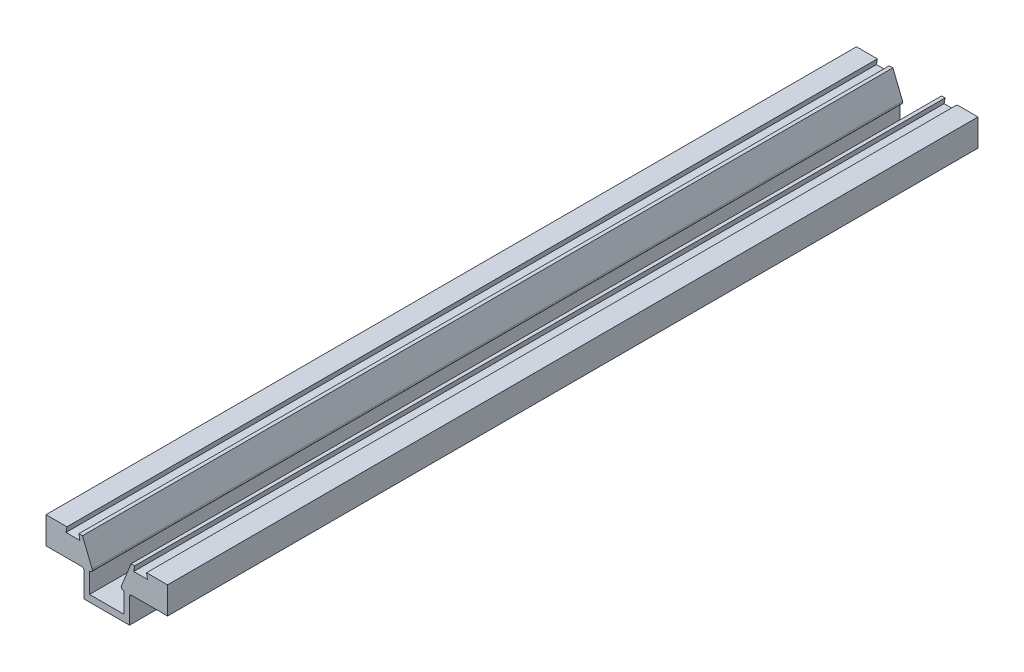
ISO-10303-21;
HEADER;
FILE_DESCRIPTION(('STEP AP214'),'2;1');
FILE_NAME('part.step','',(''),(''),'','','');
FILE_SCHEMA(('AUTOMOTIVE_DESIGN { 1 0 10303 214 1 1 1 1 }'));
ENDSEC;
DATA;
#1=APPLICATION_CONTEXT('core data for automotive mechanical design processes');
#2=APPLICATION_PROTOCOL_DEFINITION('international standard','automotive_design',2000,#1);
#3=PRODUCT_CONTEXT('',#1,'mechanical');
#4=PRODUCT('Part','Part','',(#3));
#5=PRODUCT_RELATED_PRODUCT_CATEGORY('part','',(#4));
#6=PRODUCT_DEFINITION_FORMATION('','',#4);
#7=PRODUCT_DEFINITION_CONTEXT('part definition',#1,'design');
#8=PRODUCT_DEFINITION('design','',#6,#7);
#9=PRODUCT_DEFINITION_SHAPE('','',#8);
#10=(LENGTH_UNIT() NAMED_UNIT(*) SI_UNIT(.MILLI.,.METRE.));
#11=(NAMED_UNIT(*) PLANE_ANGLE_UNIT() SI_UNIT($,.RADIAN.));
#12=(NAMED_UNIT(*) SI_UNIT($,.STERADIAN.) SOLID_ANGLE_UNIT());
#13=UNCERTAINTY_MEASURE_WITH_UNIT(LENGTH_MEASURE(1.E-05),#10,'distance_accuracy_value','');
#14=(GEOMETRIC_REPRESENTATION_CONTEXT(3) GLOBAL_UNCERTAINTY_ASSIGNED_CONTEXT((#13)) GLOBAL_UNIT_ASSIGNED_CONTEXT((#10,
#11,#12)) REPRESENTATION_CONTEXT('',''));
#15=CARTESIAN_POINT('',(0.,0.,0.));
#16=DIRECTION('',(0.,0.,1.));
#17=DIRECTION('',(1.,0.,0.));
#18=AXIS2_PLACEMENT_3D('',#15,#16,#17);
#19=CARTESIAN_POINT('',(3.90257444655,-6.35,190.4873));
#20=CARTESIAN_POINT('',(3.83520945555,-6.35,190.4873));
#21=CARTESIAN_POINT('',(3.770408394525,-6.33711025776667,190.4873));
#22=CARTESIAN_POINT('',(3.708171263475,-6.3113307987,190.4873));
#23=CARTESIAN_POINT('',(3.645934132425,-6.28555133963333,190.4873));
#24=CARTESIAN_POINT('',(3.5909984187,-6.24884447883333,190.4873));
#25=CARTESIAN_POINT('',(3.54336417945,-6.2012102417,190.4873));
#26=CARTESIAN_POINT('',(3.4957299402,-6.15357600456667,190.4873));
#27=CARTESIAN_POINT('',(3.459023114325,-6.09864030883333,190.4873));
#28=CARTESIAN_POINT('',(3.433243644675,-6.0364031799,190.4873));
#29=CARTESIAN_POINT('',(3.407464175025,-5.97416605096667,190.4873));
#30=CARTESIAN_POINT('',(3.3945744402,-5.909364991,190.4873));
#31=CARTESIAN_POINT('',(3.3945744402,-5.842,190.4873));
#32=CARTESIAN_POINT('',(3.90257444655,-6.35,-0.0126999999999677));
#33=CARTESIAN_POINT('',(3.83520945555,-6.35,-0.0126999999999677));
#34=CARTESIAN_POINT('',(3.770408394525,-6.33711025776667,-0.0126999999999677));
#35=CARTESIAN_POINT('',(3.708171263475,-6.3113307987,-0.0126999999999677));
#36=CARTESIAN_POINT('',(3.645934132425,-6.28555133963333,-0.0126999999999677));
#37=CARTESIAN_POINT('',(3.5909984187,-6.24884447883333,-0.0126999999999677));
#38=CARTESIAN_POINT('',(3.54336417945,-6.2012102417,-0.0126999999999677));
#39=CARTESIAN_POINT('',(3.4957299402,-6.15357600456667,-0.0126999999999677));
#40=CARTESIAN_POINT('',(3.459023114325,-6.09864030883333,-0.0126999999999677));
#41=CARTESIAN_POINT('',(3.433243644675,-6.0364031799,-0.0126999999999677));
#42=CARTESIAN_POINT('',(3.407464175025,-5.97416605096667,-0.0126999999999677));
#43=CARTESIAN_POINT('',(3.3945744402,-5.909364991,-0.0126999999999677));
#44=CARTESIAN_POINT('',(3.3945744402,-5.842,-0.0126999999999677));
#45=B_SPLINE_SURFACE_WITH_KNOTS('',1,3,((#19,#20,#21,#22,#23,#24,#25,#26,#27,#28,#29,#30,#31),
(#32,#33,#34,#35,#36,#37,#38,#39,#40,#41,#42,#43,#44)),.UNSPECIFIED.,.F.,.F.,.F.,(2,2),(4,3,3,3,
4),(0.,1.),(0.,0.25,0.5,0.75,1.),.UNSPECIFIED.);
#46=DIRECTION('',(0.,0.,1.));
#47=VECTOR('',#46,1.);
#48=CARTESIAN_POINT('',(3.90257444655,-6.35,95.2373));
#49=LINE('',#48,#47);
#50=CARTESIAN_POINT('',(3.90257444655,-6.35,-0.0126999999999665));
#51=VERTEX_POINT('',#50);
#52=CARTESIAN_POINT('',(3.90257444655,-6.35,190.4873));
#53=VERTEX_POINT('',#52);
#54=EDGE_CURVE('E565',#51,#53,#49,.T.);
#55=CARTESIAN_POINT('',(3.3945744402,-5.842,190.4873));
#56=CARTESIAN_POINT('',(3.39456829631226,-5.85632478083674,190.4873));
#57=CARTESIAN_POINT('',(3.39515688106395,-5.87065217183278,190.4873));
#58=CARTESIAN_POINT('',(3.39753884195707,-5.89920065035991,190.4873));
#59=CARTESIAN_POINT('',(3.39933176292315,-5.91342177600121,190.4873));
#60=CARTESIAN_POINT('',(3.40413626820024,-5.94164875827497,190.4873));
#61=CARTESIAN_POINT('',(3.40714712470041,-5.95565473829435,190.4873));
#62=CARTESIAN_POINT('',(3.41436087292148,-5.98335716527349,190.4873));
#63=CARTESIAN_POINT('',(3.41856390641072,-5.99705357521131,190.4873));
#64=CARTESIAN_POINT('',(3.42809396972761,-6.02404969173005,190.4873));
#65=CARTESIAN_POINT('',(3.433421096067,-6.03734936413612,190.4873));
#66=CARTESIAN_POINT('',(3.44514776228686,-6.06346696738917,190.4873));
#67=CARTESIAN_POINT('',(3.45154723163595,-6.07628492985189,190.4873));
#68=CARTESIAN_POINT('',(3.46541908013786,-6.10132616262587,190.4873));
#69=CARTESIAN_POINT('',(3.47289135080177,-6.11354949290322,190.4873));
#70=CARTESIAN_POINT('',(3.48886057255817,-6.13730678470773,190.4873));
#71=CARTESIAN_POINT('',(3.49735750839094,-6.14884075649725,190.4873));
#72=CARTESIAN_POINT('',(3.51528355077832,-6.1711125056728,190.4873));
#73=CARTESIAN_POINT('',(3.52471028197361,-6.18185219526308,190.4873));
#74=CARTESIAN_POINT('',(3.54440399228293,-6.2025266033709,190.4873));
#75=CARTESIAN_POINT('',(3.55467106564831,-6.21246123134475,190.4873));
#76=CARTESIAN_POINT('',(3.58667436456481,-6.2409255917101,190.4873));
#77=CARTESIAN_POINT('',(3.6096248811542,-6.25813099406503,190.4873));
#78=CARTESIAN_POINT('',(3.65819134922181,-6.28836409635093,190.4873));
#79=CARTESIAN_POINT('',(3.68381467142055,-6.3013798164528,190.4873));
#80=CARTESIAN_POINT('',(3.73683677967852,-6.32305546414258,190.4873));
#81=CARTESIAN_POINT('',(3.76423440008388,-6.33171821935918,190.4873));
#82=CARTESIAN_POINT('',(3.8102788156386,-6.34199463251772,190.4873));
#83=CARTESIAN_POINT('',(3.82862058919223,-6.34501536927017,190.4873));
#84=CARTESIAN_POINT('',(3.86550002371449,-6.34902363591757,190.4873));
#85=CARTESIAN_POINT('',(3.88403737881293,-6.35001397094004,190.4873));
#86=CARTESIAN_POINT('',(3.90257444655,-6.35,190.4873));
#87=B_SPLINE_CURVE_WITH_KNOTS('',3,(#55,#56,#57,#58,#59,#60,#61,#62,#63,#64,#65,#66,#67,#68,#69,
#70,#71,#72,#73,#74,#75,#76,#77,#78,#79,#80,#81,#82,#83,#84,#85,#86),.UNSPECIFIED.,.F.,.F.,(4,2,
2,2,2,2,2,2,2,2,2,2,2,2,2,4),(0.,0.0429657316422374,0.0859152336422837,0.12883910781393,
0.171768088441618,0.214700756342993,0.257630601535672,0.300556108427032,0.343480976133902,
0.386298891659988,0.429121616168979,0.51470928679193,0.600539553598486,0.686313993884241,
0.741972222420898,0.797553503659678),.UNSPECIFIED.);
#88=CARTESIAN_POINT('',(3.3945744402,-5.842,190.4873));
#89=VERTEX_POINT('',#88);
#90=EDGE_CURVE('E18',#89,#53,#87,.T.);
#91=DIRECTION('',(0.,0.,-1.));
#92=VECTOR('',#91,1.);
#93=CARTESIAN_POINT('',(3.3945744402,-5.842,95.2373));
#94=LINE('',#93,#92);
#95=CARTESIAN_POINT('',(3.3945744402,-5.842,-0.0126999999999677));
#96=VERTEX_POINT('',#95);
#97=EDGE_CURVE('E368',#89,#96,#94,.T.);
#98=CARTESIAN_POINT('',(3.90257444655,-6.35,-0.0126999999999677));
#99=CARTESIAN_POINT('',(3.88824966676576,-6.35000614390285,-0.0126999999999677));
#100=CARTESIAN_POINT('',(3.87392227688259,-6.34941755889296,-0.0126999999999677));
#101=CARTESIAN_POINT('',(3.84537380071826,-6.34703559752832,-0.0126999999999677));
#102=CARTESIAN_POINT('',(3.83115267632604,-6.34524267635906,-0.0126999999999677));
#103=CARTESIAN_POINT('',(3.80292569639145,-6.3404381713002,-0.0126999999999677));
#104=CARTESIAN_POINT('',(3.78891971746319,-6.33742731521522,-0.0126999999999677));
#105=CARTESIAN_POINT('',(3.76121729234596,-6.33021356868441,-0.0126999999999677));
#106=CARTESIAN_POINT('',(3.74752088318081,-6.32601053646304,-0.0126999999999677));
#107=CARTESIAN_POINT('',(3.72052476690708,-6.31648047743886,-0.0126999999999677));
#108=CARTESIAN_POINT('',(3.70722509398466,-6.3111533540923,-0.0126999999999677));
#109=CARTESIAN_POINT('',(3.68110749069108,-6.29942669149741,-0.0126999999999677));
#110=CARTESIAN_POINT('',(3.66828952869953,-6.29302722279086,-0.0126999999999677));
#111=CARTESIAN_POINT('',(3.64324829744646,-6.2791553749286,-0.0126999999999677));
#112=CARTESIAN_POINT('',(3.63102496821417,-6.27168310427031,-0.0126999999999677));
#113=CARTESIAN_POINT('',(3.60726767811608,-6.2557138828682,-0.0126999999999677));
#114=CARTESIAN_POINT('',(3.59573370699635,-6.24721694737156,-0.0126999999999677));
#115=CARTESIAN_POINT('',(3.57346196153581,-6.22929090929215,-0.0126999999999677));
#116=CARTESIAN_POINT('',(3.56272227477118,-6.21986418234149,-0.0126999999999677));
#117=CARTESIAN_POINT('',(3.54204787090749,-6.20017048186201,-0.0126999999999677));
#118=CARTESIAN_POINT('',(3.53211324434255,-6.18990341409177,-0.0126999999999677));
#119=CARTESIAN_POINT('',(3.50364888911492,-6.15790013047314,-0.0126999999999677));
#120=CARTESIAN_POINT('',(3.48644349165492,-6.1349496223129,-0.0126999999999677));
#121=CARTESIAN_POINT('',(3.45621039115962,-6.08638317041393,-0.0126999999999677));
#122=CARTESIAN_POINT('',(3.44319466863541,-6.06075985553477,-0.0126999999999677));
#123=CARTESIAN_POINT('',(3.42151901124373,-6.00773776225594,-0.0126999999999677));
#124=CARTESIAN_POINT('',(3.41285624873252,-5.98034014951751,-0.0126999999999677));
#125=CARTESIAN_POINT('',(3.40257982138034,-5.93429572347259,-0.0126999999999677));
#126=CARTESIAN_POINT('',(3.39955907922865,-5.91595393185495,-0.0126999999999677));
#127=CARTESIAN_POINT('',(3.39555080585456,-5.87907446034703,-0.0126999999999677));
#128=CARTESIAN_POINT('',(3.39456046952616,-5.86053708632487,-0.0126999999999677));
#129=CARTESIAN_POINT('',(3.3945744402,-5.842,-0.0126999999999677));
#130=B_SPLINE_CURVE_WITH_KNOTS('',3,(#98,#99,#100,#101,#102,#103,#104,#105,#106,#107,#108,#109,
#110,#111,#112,#113,#114,#115,#116,#117,#118,#119,#120,#121,#122,#123,#124,#125,#126,#127,#128,
#129),.UNSPECIFIED.,.F.,.F.,(4,2,2,2,2,2,2,2,2,2,2,2,2,2,2,4),(0.,0.0429657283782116,
0.085915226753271,0.128839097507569,0.17176807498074,0.214700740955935,0.257630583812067,
0.300556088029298,0.343480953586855,0.386298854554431,0.429121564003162,0.514709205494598,
0.600539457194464,0.686313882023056,0.741972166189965,0.797553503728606),.UNSPECIFIED.);
#131=EDGE_CURVE('E373',#51,#96,#130,.T.);
#132=ORIENTED_EDGE('',*,*,#54,.T.);
#133=ORIENTED_EDGE('',*,*,#90,.F.);
#134=ORIENTED_EDGE('',*,*,#97,.T.);
#135=ORIENTED_EDGE('',*,*,#131,.F.);
#136=EDGE_LOOP('',(#132,#133,#134,#135));
#137=FACE_BOUND('',#136,.T.);
#138=ADVANCED_FACE('F14',(#137),#45,.F.);
#139=CARTESIAN_POINT('',(6.553199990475,0.,190.4873));
#140=DIRECTION('',(-0.984807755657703,0.173648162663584,0.));
#141=DIRECTION('',(0.,0.,-1.));
#142=AXIS2_PLACEMENT_3D('',#139,#140,#141);
#143=PLANE('',#142);
#144=DIRECTION('',(0.,0.,1.));
#145=VECTOR('',#144,1.);
#146=CARTESIAN_POINT('',(6.553199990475,0.,95.2373));
#147=LINE('',#146,#145);
#148=CARTESIAN_POINT('',(6.553199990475,0.,-0.012699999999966));
#149=VERTEX_POINT('',#148);
#150=CARTESIAN_POINT('',(6.553199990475,0.,190.4873));
#151=VERTEX_POINT('',#150);
#152=EDGE_CURVE('E235',#149,#151,#147,.T.);
#153=ORIENTED_EDGE('',*,*,#152,.T.);
#154=DIRECTION('',(0.173648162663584,0.984807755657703,0.));
#155=VECTOR('',#154,1.);
#156=CARTESIAN_POINT('',(6.4412323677,-0.635,190.4873));
#157=LINE('',#156,#155);
#158=CARTESIAN_POINT('',(6.329264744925,-1.27,190.4873));
#159=VERTEX_POINT('',#158);
#160=EDGE_CURVE('E135',#159,#151,#157,.T.);
#161=ORIENTED_EDGE('',*,*,#160,.F.);
#162=DIRECTION('',(0.,0.,-1.));
#163=VECTOR('',#162,1.);
#164=CARTESIAN_POINT('',(6.329264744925,-1.27,95.2373));
#165=LINE('',#164,#163);
#166=CARTESIAN_POINT('',(6.329264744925,-1.27,-0.0126999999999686));
#167=VERTEX_POINT('',#166);
#168=EDGE_CURVE('E248',#159,#167,#165,.T.);
#169=ORIENTED_EDGE('',*,*,#168,.T.);
#170=DIRECTION('',(-0.173648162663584,-0.984807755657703,0.));
#171=VECTOR('',#170,1.);
#172=CARTESIAN_POINT('',(6.4412323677,-0.635,-0.0126999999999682));
#173=LINE('',#172,#171);
#174=EDGE_CURVE('E223',#149,#167,#173,.T.);
#175=ORIENTED_EDGE('',*,*,#174,.F.);
#176=EDGE_LOOP('',(#153,#161,#169,#175));
#177=FACE_BOUND('',#176,.T.);
#178=ADVANCED_FACE('F396',(#177),#143,.F.);
#179=CARTESIAN_POINT('',(5.715,0.,190.4873));
#180=DIRECTION('',(0.,-1.,0.));
#181=DIRECTION('',(0.,0.,-1.));
#182=AXIS2_PLACEMENT_3D('',#179,#180,#181);
#183=PLANE('',#182);
#184=DIRECTION('',(0.,0.,1.));
#185=VECTOR('',#184,1.);
#186=CARTESIAN_POINT('',(5.715,0.,95.2373));
#187=LINE('',#186,#185);
#188=CARTESIAN_POINT('',(5.715,0.,-0.0126999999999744));
#189=VERTEX_POINT('',#188);
#190=CARTESIAN_POINT('',(5.715,0.,190.4873));
#191=VERTEX_POINT('',#190);
#192=EDGE_CURVE('E232',#189,#191,#187,.T.);
#193=ORIENTED_EDGE('',*,*,#192,.T.);
#194=DIRECTION('',(-1.,0.,0.));
#195=VECTOR('',#194,1.);
#196=CARTESIAN_POINT('',(6.1340999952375,0.,190.4873));
#197=LINE('',#196,#195);
#198=EDGE_CURVE('E238',#151,#191,#197,.T.);
#199=ORIENTED_EDGE('',*,*,#198,.F.);
#200=ORIENTED_EDGE('',*,*,#152,.F.);
#201=DIRECTION('',(1.,0.,0.));
#202=VECTOR('',#201,1.);
#203=CARTESIAN_POINT('',(6.1340999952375,0.,-0.0126999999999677));
#204=LINE('',#203,#202);
#205=EDGE_CURVE('E229',#189,#149,#204,.T.);
#206=ORIENTED_EDGE('',*,*,#205,.F.);
#207=EDGE_LOOP('',(#193,#199,#200,#206));
#208=FACE_BOUND('',#207,.T.);
#209=ADVANCED_FACE('F231',(#208),#183,.F.);
#210=CARTESIAN_POINT('',(3.3945744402,-5.842,190.4873));
#211=CARTESIAN_POINT('',(3.3945744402,-5.77616987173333,190.4873));
#212=CARTESIAN_POINT('',(3.406904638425,-5.71273648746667,190.4873));
#213=CARTESIAN_POINT('',(3.431565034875,-5.6516998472,190.4873));
#214=CARTESIAN_POINT('',(3.3945744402,-5.842,-0.0126999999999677));
#215=CARTESIAN_POINT('',(3.3945744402,-5.77616987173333,-0.0126999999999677));
#216=CARTESIAN_POINT('',(3.406904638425,-5.71273648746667,-0.0126999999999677));
#217=CARTESIAN_POINT('',(3.431565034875,-5.6516998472,-0.0126999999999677));
#218=B_SPLINE_SURFACE_WITH_KNOTS('',1,3,((#210,#211,#212,#213),(#214,#215,#216,#217)),
.UNSPECIFIED.,.F.,.F.,.F.,(2,2),(4,4),(0.,1.),(0.,1.),.UNSPECIFIED.);
#219=CARTESIAN_POINT('',(3.431565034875,-5.6516998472,190.4873));
#220=CARTESIAN_POINT('',(3.42538191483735,-5.66697624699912,190.4873));
#221=CARTESIAN_POINT('',(3.41993230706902,-5.68255395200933,190.4873));
#222=CARTESIAN_POINT('',(3.41057380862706,-5.71416630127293,190.4873));
#223=CARTESIAN_POINT('',(3.40666503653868,-5.73020098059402,190.4873));
#224=CARTESIAN_POINT('',(3.40055027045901,-5.76212297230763,190.4873));
#225=CARTESIAN_POINT('',(3.39829939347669,-5.77800170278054,190.4873));
#226=CARTESIAN_POINT('',(3.39530608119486,-5.80992145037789,190.4873));
#227=CARTESIAN_POINT('',(3.39456555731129,-5.82596264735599,190.4873));
#228=CARTESIAN_POINT('',(3.3945744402,-5.842,190.4873));
#229=B_SPLINE_CURVE_WITH_KNOTS('',3,(#219,#220,#221,#222,#223,#224,#225,#226,#227,#228),
.UNSPECIFIED.,.F.,.F.,(4,2,2,2,4),(0.,0.0494287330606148,0.098861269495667,0.146900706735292,
0.195000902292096),.UNSPECIFIED.);
#230=CARTESIAN_POINT('',(3.431565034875,-5.6516998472,190.4873));
#231=VERTEX_POINT('',#230);
#232=EDGE_CURVE('E237',#231,#89,#229,.T.);
#233=DIRECTION('',(0.,0.,-1.));
#234=VECTOR('',#233,1.);
#235=CARTESIAN_POINT('',(3.431565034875,-5.6516998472,95.2373));
#236=LINE('',#235,#234);
#237=CARTESIAN_POINT('',(3.431565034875,-5.6516998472,-0.0126999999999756));
#238=VERTEX_POINT('',#237);
#239=EDGE_CURVE('E247',#231,#238,#236,.T.);
#240=CARTESIAN_POINT('',(3.3945744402,-5.842,-0.0126999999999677));
#241=CARTESIAN_POINT('',(3.39456418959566,-5.82551973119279,-0.0126999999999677));
#242=CARTESIAN_POINT('',(3.3953469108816,-5.80903487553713,-0.0126999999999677));
#243=CARTESIAN_POINT('',(3.39851205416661,-5.77621866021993,-0.0126999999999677));
#244=CARTESIAN_POINT('',(3.40089459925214,-5.75988731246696,-0.0126999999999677));
#245=CARTESIAN_POINT('',(3.40718327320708,-5.72799912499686,-0.0126999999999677));
#246=CARTESIAN_POINT('',(3.41104457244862,-5.71243342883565,-0.0126999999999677));
#247=CARTESIAN_POINT('',(3.42022656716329,-5.68171663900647,-0.0126999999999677));
#248=CARTESIAN_POINT('',(3.42554910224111,-5.66656609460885,-0.0126999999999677));
#249=CARTESIAN_POINT('',(3.431565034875,-5.6516998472,-0.0126999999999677));
#250=B_SPLINE_CURVE_WITH_KNOTS('',3,(#240,#241,#242,#243,#244,#245,#246,#247,#248,#249),
.UNSPECIFIED.,.F.,.F.,(4,2,2,2,4),(0.,0.0494287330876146,0.0988612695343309,0.146900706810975,
0.19500090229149),.UNSPECIFIED.);
#251=EDGE_CURVE('E253',#96,#238,#250,.T.);
#252=ORIENTED_EDGE('',*,*,#97,.F.);
#253=ORIENTED_EDGE('',*,*,#232,.F.);
#254=ORIENTED_EDGE('',*,*,#239,.T.);
#255=ORIENTED_EDGE('',*,*,#251,.F.);
#256=EDGE_LOOP('',(#252,#253,#254,#255));
#257=FACE_BOUND('',#256,.T.);
#258=ADVANCED_FACE('F378',(#257),#218,.F.);
#259=CARTESIAN_POINT('',(4.06399999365,-6.35,190.4873));
#260=DIRECTION('',(0.,1.,0.));
#261=DIRECTION('',(0.,0.,-1.));
#262=AXIS2_PLACEMENT_3D('',#259,#260,#261);
#263=PLANE('',#262);
#264=DIRECTION('',(0.,0.,1.));
#265=VECTOR('',#264,1.);
#266=CARTESIAN_POINT('',(4.06399999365,-6.35,95.2373));
#267=LINE('',#266,#265);
#268=CARTESIAN_POINT('',(4.06399999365,-6.35,-0.0126999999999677));
#269=VERTEX_POINT('',#268);
#270=CARTESIAN_POINT('',(4.06399999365,-6.35,190.4873));
#271=VERTEX_POINT('',#270);
#272=EDGE_CURVE('E570',#269,#271,#267,.T.);
#273=ORIENTED_EDGE('',*,*,#272,.T.);
#274=DIRECTION('',(1.,0.,0.));
#275=VECTOR('',#274,1.);
#276=CARTESIAN_POINT('',(3.9832872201,-6.35,190.4873));
#277=LINE('',#276,#275);
#278=EDGE_CURVE('E567',#53,#271,#277,.T.);
#279=ORIENTED_EDGE('',*,*,#278,.F.);
#280=ORIENTED_EDGE('',*,*,#54,.F.);
#281=DIRECTION('',(-1.,0.,0.));
#282=VECTOR('',#281,1.);
#283=CARTESIAN_POINT('',(3.9832872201,-6.35,-0.0126999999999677));
#284=LINE('',#283,#282);
#285=EDGE_CURVE('E553',#269,#51,#284,.T.);
#286=ORIENTED_EDGE('',*,*,#285,.F.);
#287=EDGE_LOOP('',(#273,#279,#280,#286));
#288=FACE_BOUND('',#287,.T.);
#289=ADVANCED_FACE('F383',(#288),#263,.F.);
#290=CARTESIAN_POINT('',(-3.90257444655,-6.35,190.4873));
#291=DIRECTION('',(0.,1.,0.));
#292=DIRECTION('',(0.,0.,-1.));
#293=AXIS2_PLACEMENT_3D('',#290,#291,#292);
#294=PLANE('',#293);
#295=DIRECTION('',(0.,0.,1.));
#296=VECTOR('',#295,1.);
#297=CARTESIAN_POINT('',(-3.90257444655,-6.35,95.2373));
#298=LINE('',#297,#296);
#299=CARTESIAN_POINT('',(-3.90257444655,-6.35,-0.0126999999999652));
#300=VERTEX_POINT('',#299);
#301=CARTESIAN_POINT('',(-3.90257444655,-6.35,190.4873));
#302=VERTEX_POINT('',#301);
#303=EDGE_CURVE('E546',#300,#302,#298,.T.);
#304=ORIENTED_EDGE('',*,*,#303,.T.);
#305=DIRECTION('',(1.,0.,0.));
#306=VECTOR('',#305,1.);
#307=CARTESIAN_POINT('',(-3.9832872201,-6.35,190.4873));
#308=LINE('',#307,#306);
#309=CARTESIAN_POINT('',(-4.06399999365,-6.35,190.4873));
#310=VERTEX_POINT('',#309);
#311=EDGE_CURVE('E551',#310,#302,#308,.T.);
#312=ORIENTED_EDGE('',*,*,#311,.F.);
#313=DIRECTION('',(0.,0.,-1.));
#314=VECTOR('',#313,1.);
#315=CARTESIAN_POINT('',(-4.06399999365,-6.35,95.2373));
#316=LINE('',#315,#314);
#317=CARTESIAN_POINT('',(-4.06399999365,-6.35,-0.0126999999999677));
#318=VERTEX_POINT('',#317);
#319=EDGE_CURVE('E554',#310,#318,#316,.T.);
#320=ORIENTED_EDGE('',*,*,#319,.T.);
#321=DIRECTION('',(-1.,0.,0.));
#322=VECTOR('',#321,1.);
#323=CARTESIAN_POINT('',(-3.9832872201,-6.35,-0.0126999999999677));
#324=LINE('',#323,#322);
#325=EDGE_CURVE('E549',#300,#318,#324,.T.);
#326=ORIENTED_EDGE('',*,*,#325,.F.);
#327=EDGE_LOOP('',(#304,#312,#320,#326));
#328=FACE_BOUND('',#327,.T.);
#329=ADVANCED_FACE('F410',(#328),#294,.F.);
#330=CARTESIAN_POINT('',(-3.431565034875,-5.6516998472,190.4873));
#331=CARTESIAN_POINT('',(-3.415987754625,-5.69025497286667,190.4873));
#332=CARTESIAN_POINT('',(-3.4053054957,-5.7301217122,190.4873));
#333=CARTESIAN_POINT('',(-3.3995182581,-5.7713000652,190.4873));
#334=CARTESIAN_POINT('',(-3.3937310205,-5.8124784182,190.4873));
#335=CARTESIAN_POINT('',(-3.39301068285,-5.8537452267,190.4873));
#336=CARTESIAN_POINT('',(-3.3973573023,-5.8951004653,190.4873));
#337=CARTESIAN_POINT('',(-3.40170392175,-5.9364557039,190.4873));
#338=CARTESIAN_POINT('',(-3.410988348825,-5.97667096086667,190.4873));
#339=CARTESIAN_POINT('',(-3.425210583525,-6.0157462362,190.4873));
#340=CARTESIAN_POINT('',(-3.439432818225,-6.05482151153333,190.4873));
#341=CARTESIAN_POINT('',(-3.45817040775,-6.09159608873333,190.4873));
#342=CARTESIAN_POINT('',(-3.4814233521,-6.1260699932,190.4873));
#343=CARTESIAN_POINT('',(-3.50467629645,-6.16054389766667,190.4873));
#344=CARTESIAN_POINT('',(-3.53175385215,-6.1916930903,190.4873));
#345=CARTESIAN_POINT('',(-3.56265607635,-6.2195175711,190.4873));
#346=CARTESIAN_POINT('',(-3.59355830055,-6.2473420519,190.4873));
#347=CARTESIAN_POINT('',(-3.627367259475,-6.27101533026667,190.4873));
#348=CARTESIAN_POINT('',(-3.664082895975,-6.2905373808,190.4873));
#349=CARTESIAN_POINT('',(-3.700798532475,-6.31005943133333,190.4873));
#350=CARTESIAN_POINT('',(-3.73933027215,-6.3248503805,190.4873));
#351=CARTESIAN_POINT('',(-3.779678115,-6.3349102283,190.4873));
#352=CARTESIAN_POINT('',(-3.82002595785,-6.3449700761,190.4873));
#353=CARTESIAN_POINT('',(-3.8609914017,-6.35,190.4873));
#354=CARTESIAN_POINT('',(-3.90257444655,-6.35,190.4873));
#355=CARTESIAN_POINT('',(-3.431565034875,-5.6516998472,-0.0126999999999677));
#356=CARTESIAN_POINT('',(-3.415987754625,-5.69025497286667,-0.0126999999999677));
#357=CARTESIAN_POINT('',(-3.4053054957,-5.7301217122,-0.0126999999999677));
#358=CARTESIAN_POINT('',(-3.3995182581,-5.7713000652,-0.0126999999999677));
#359=CARTESIAN_POINT('',(-3.3937310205,-5.8124784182,-0.0126999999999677));
#360=CARTESIAN_POINT('',(-3.39301068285,-5.8537452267,-0.0126999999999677));
#361=CARTESIAN_POINT('',(-3.3973573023,-5.8951004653,-0.0126999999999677));
#362=CARTESIAN_POINT('',(-3.40170392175,-5.9364557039,-0.0126999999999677));
#363=CARTESIAN_POINT('',(-3.410988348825,-5.97667096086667,-0.0126999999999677));
#364=CARTESIAN_POINT('',(-3.425210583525,-6.0157462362,-0.0126999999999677));
#365=CARTESIAN_POINT('',(-3.439432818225,-6.05482151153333,-0.0126999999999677));
#366=CARTESIAN_POINT('',(-3.45817040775,-6.09159608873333,-0.0126999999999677));
#367=CARTESIAN_POINT('',(-3.4814233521,-6.1260699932,-0.0126999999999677));
#368=CARTESIAN_POINT('',(-3.50467629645,-6.16054389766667,-0.0126999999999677));
#369=CARTESIAN_POINT('',(-3.53175385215,-6.1916930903,-0.0126999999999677));
#370=CARTESIAN_POINT('',(-3.56265607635,-6.2195175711,-0.0126999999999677));
#371=CARTESIAN_POINT('',(-3.59355830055,-6.2473420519,-0.0126999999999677));
#372=CARTESIAN_POINT('',(-3.627367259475,-6.27101533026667,-0.0126999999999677));
#373=CARTESIAN_POINT('',(-3.664082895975,-6.2905373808,-0.0126999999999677));
#374=CARTESIAN_POINT('',(-3.700798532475,-6.31005943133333,-0.0126999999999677));
#375=CARTESIAN_POINT('',(-3.73933027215,-6.3248503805,-0.0126999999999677));
#376=CARTESIAN_POINT('',(-3.779678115,-6.3349102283,-0.0126999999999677));
#377=CARTESIAN_POINT('',(-3.82002595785,-6.3449700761,-0.0126999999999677));
#378=CARTESIAN_POINT('',(-3.8609914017,-6.35,-0.0126999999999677));
#379=CARTESIAN_POINT('',(-3.90257444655,-6.35,-0.0126999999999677));
#380=B_SPLINE_SURFACE_WITH_KNOTS('',1,3,((#330,#331,#332,#333,#334,#335,#336,#337,#338,#339,
#340,#341,#342,#343,#344,#345,#346,#347,#348,#349,#350,#351,#352,#353,#354),(#355,#356,#357,
#358,#359,#360,#361,#362,#363,#364,#365,#366,#367,#368,#369,#370,#371,#372,#373,#374,#375,#376,
#377,#378,#379)),.UNSPECIFIED.,.F.,.F.,.F.,(2,2),(4,3,3,3,3,3,3,3,4),(0.,1.),(0.,0.125,0.25,
0.375,0.5,0.625,0.75,0.875,1.),.UNSPECIFIED.);
#381=DIRECTION('',(0.,0.,1.));
#382=VECTOR('',#381,1.);
#383=CARTESIAN_POINT('',(-3.431565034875,-5.6516998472,95.2373));
#384=LINE('',#383,#382);
#385=CARTESIAN_POINT('',(-3.431565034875,-5.6516998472,-0.0126999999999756));
#386=VERTEX_POINT('',#385);
#387=CARTESIAN_POINT('',(-3.43156503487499,-5.65169984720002,190.4873));
#388=VERTEX_POINT('',#387);
#389=EDGE_CURVE('E557',#386,#388,#384,.T.);
#390=CARTESIAN_POINT('',(-3.90257444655,-6.35,190.4873));
#391=CARTESIAN_POINT('',(-3.87398171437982,-6.35002721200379,190.4873));
#392=CARTESIAN_POINT('',(-3.84539442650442,-6.34759457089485,190.4873));
#393=CARTESIAN_POINT('',(-3.78904913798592,-6.33798308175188,190.4873));
#394=CARTESIAN_POINT('',(-3.76129056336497,-6.3308076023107,190.4873));
#395=CARTESIAN_POINT('',(-3.707364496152,-6.31187865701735,190.4873));
#396=CARTESIAN_POINT('',(-3.68119782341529,-6.30012285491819,190.4873));
#397=CARTESIAN_POINT('',(-3.63121069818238,-6.27239673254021,190.4873));
#398=CARTESIAN_POINT('',(-3.60738971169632,-6.25642737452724,190.4873));
#399=CARTESIAN_POINT('',(-3.56283556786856,-6.22076755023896,190.4873));
#400=CARTESIAN_POINT('',(-3.54209328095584,-6.20108849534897,190.4873));
#401=CARTESIAN_POINT('',(-3.50417285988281,-6.15849252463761,190.4873));
#402=CARTESIAN_POINT('',(-3.48700088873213,-6.1355701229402,190.4873));
#403=CARTESIAN_POINT('',(-3.45668169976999,-6.0870812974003,190.4873));
#404=CARTESIAN_POINT('',(-3.44355002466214,-6.06150515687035,190.4873));
#405=CARTESIAN_POINT('',(-3.42179406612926,-6.00855271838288,190.4873));
#406=CARTESIAN_POINT('',(-3.41316213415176,-5.98117956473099,190.4873));
#407=CARTESIAN_POINT('',(-3.400645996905,-5.92543455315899,190.4873));
#408=CARTESIAN_POINT('',(-3.39675117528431,-5.89706507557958,190.4873));
#409=CARTESIAN_POINT('',(-3.3937754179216,-5.84007469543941,190.4873));
#410=CARTESIAN_POINT('',(-3.39469368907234,-5.81145383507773,190.4873));
#411=CARTESIAN_POINT('',(-3.40062341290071,-5.76058477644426,190.4873));
#412=CARTESIAN_POINT('',(-3.40475927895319,-5.7382304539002,190.4873));
#413=CARTESIAN_POINT('',(-3.41597446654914,-5.69429472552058,190.4873));
#414=CARTESIAN_POINT('',(-3.42305116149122,-5.67271264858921,190.4873));
#415=CARTESIAN_POINT('',(-3.43156503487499,-5.65169984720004,190.4873));
#416=B_SPLINE_CURVE_WITH_KNOTS('',3,(#390,#391,#392,#393,#394,#395,#396,#397,#398,#399,#400,
#401,#402,#403,#404,#405,#406,#407,#408,#409,#410,#411,#412,#413,#414,#415),.UNSPECIFIED.,.F.,
.F.,(4,2,2,2,2,2,2,2,2,2,2,2,4),(0.,0.0856668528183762,0.171272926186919,0.256922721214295,
0.342552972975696,0.427923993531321,0.513441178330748,0.599283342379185,0.684979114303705,
0.770482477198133,0.855971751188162,0.92397600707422,0.991919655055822),.UNSPECIFIED.);
#417=EDGE_CURVE('E354',#302,#388,#416,.T.);
#418=CARTESIAN_POINT('',(-3.431565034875,-5.6516998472,-0.0126999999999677));
#419=CARTESIAN_POINT('',(-3.42082878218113,-5.67820036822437,-0.0126999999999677));
#420=CARTESIAN_POINT('',(-3.41237530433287,-5.70561731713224,-0.0126999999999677));
#421=CARTESIAN_POINT('',(-3.40017960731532,-5.76146027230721,-0.0126999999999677));
#422=CARTESIAN_POINT('',(-3.3964340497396,-5.78988554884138,-0.0126999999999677));
#423=CARTESIAN_POINT('',(-3.39378359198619,-5.8469758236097,-0.0126999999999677));
#424=CARTESIAN_POINT('',(-3.39488116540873,-5.87564093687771,-0.0126999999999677));
#425=CARTESIAN_POINT('',(-3.40186286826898,-5.93237457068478,-0.0126999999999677));
#426=CARTESIAN_POINT('',(-3.40774590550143,-5.960443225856,-0.0126999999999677));
#427=CARTESIAN_POINT('',(-3.42411883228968,-6.01511147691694,-0.0126999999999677));
#428=CARTESIAN_POINT('',(-3.4345947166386,-6.04171526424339,-0.0126999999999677));
#429=CARTESIAN_POINT('',(-3.45988372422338,-6.09283114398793,-0.0126999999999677));
#430=CARTESIAN_POINT('',(-3.47470424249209,-6.11733957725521,-0.0126999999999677));
#431=CARTESIAN_POINT('',(-3.50830449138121,-6.16361527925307,-0.0126999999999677));
#432=CARTESIAN_POINT('',(-3.5270990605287,-6.185371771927,-0.0126999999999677));
#433=CARTESIAN_POINT('',(-3.56804578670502,-6.22537991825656,-0.0126999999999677));
#434=CARTESIAN_POINT('',(-3.59019216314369,-6.24363748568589,-0.0126999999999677));
#435=CARTESIAN_POINT('',(-3.63718940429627,-6.27612470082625,-0.0126999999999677));
#436=CARTESIAN_POINT('',(-3.66203408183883,-6.29036330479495,-0.0126999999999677));
#437=CARTESIAN_POINT('',(-3.7137598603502,-6.31447136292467,-0.0126999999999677));
#438=CARTESIAN_POINT('',(-3.74064062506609,-6.32434153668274,-0.0126999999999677));
#439=CARTESIAN_POINT('',(-3.79002692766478,-6.33789951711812,-0.0126999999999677));
#440=CARTESIAN_POINT('',(-3.81230286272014,-6.34243890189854,-0.0126999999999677));
#441=CARTESIAN_POINT('',(-3.85724073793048,-6.34849899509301,-0.0126999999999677));
#442=CARTESIAN_POINT('',(-3.87990231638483,-6.35002239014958,-0.0126999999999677));
#443=CARTESIAN_POINT('',(-3.90257444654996,-6.35,-0.0126999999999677));
#444=B_SPLINE_CURVE_WITH_KNOTS('',3,(#418,#419,#420,#421,#422,#423,#424,#425,#426,#427,#428,
#429,#430,#431,#432,#433,#434,#435,#436,#437,#438,#439,#440,#441,#442,#443),.UNSPECIFIED.,.F.,
.F.,(4,2,2,2,2,2,2,2,2,2,2,2,4),(0.,0.0856668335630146,0.171272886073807,0.256922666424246,
0.342552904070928,0.427923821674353,0.513440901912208,0.599283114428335,0.684978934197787,
0.770482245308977,0.85597146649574,0.923975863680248,0.991919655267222),.UNSPECIFIED.);
#445=EDGE_CURVE('E339',#386,#300,#444,.T.);
#446=ORIENTED_EDGE('',*,*,#389,.T.);
#447=ORIENTED_EDGE('',*,*,#417,.F.);
#448=ORIENTED_EDGE('',*,*,#303,.F.);
#449=ORIENTED_EDGE('',*,*,#445,.F.);
#450=EDGE_LOOP('',(#446,#447,#448,#449));
#451=FACE_BOUND('',#450,.T.);
#452=ADVANCED_FACE('F315',(#451),#380,.F.);
#453=CARTESIAN_POINT('',(-6.553199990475,0.,190.4873));
#454=DIRECTION('',(0.,-1.,0.));
#455=DIRECTION('',(0.,0.,-1.));
#456=AXIS2_PLACEMENT_3D('',#453,#454,#455);
#457=PLANE('',#456);
#458=DIRECTION('',(0.,0.,1.));
#459=VECTOR('',#458,1.);
#460=CARTESIAN_POINT('',(-6.553199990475,0.,95.2373));
#461=LINE('',#460,#459);
#462=CARTESIAN_POINT('',(-6.553199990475,0.,-0.0126999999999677));
#463=VERTEX_POINT('',#462);
#464=CARTESIAN_POINT('',(-6.553199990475,0.,190.4873));
#465=VERTEX_POINT('',#464);
#466=EDGE_CURVE('E527',#463,#465,#461,.T.);
#467=ORIENTED_EDGE('',*,*,#466,.T.);
#468=DIRECTION('',(-1.,0.,0.));
#469=VECTOR('',#468,1.);
#470=CARTESIAN_POINT('',(-6.1340999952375,0.,190.4873));
#471=LINE('',#470,#469);
#472=CARTESIAN_POINT('',(-5.715,0.,190.4873));
#473=VERTEX_POINT('',#472);
#474=EDGE_CURVE('E525',#473,#465,#471,.T.);
#475=ORIENTED_EDGE('',*,*,#474,.F.);
#476=DIRECTION('',(0.,0.,-1.));
#477=VECTOR('',#476,1.);
#478=CARTESIAN_POINT('',(-5.715,0.,95.2373));
#479=LINE('',#478,#477);
#480=CARTESIAN_POINT('',(-5.715,0.,-0.0126999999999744));
#481=VERTEX_POINT('',#480);
#482=EDGE_CURVE('E632',#473,#481,#479,.T.);
#483=ORIENTED_EDGE('',*,*,#482,.T.);
#484=DIRECTION('',(1.,0.,0.));
#485=VECTOR('',#484,1.);
#486=CARTESIAN_POINT('',(-6.1340999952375,0.,-0.0126999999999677));
#487=LINE('',#486,#485);
#488=EDGE_CURVE('E146',#463,#481,#487,.T.);
#489=ORIENTED_EDGE('',*,*,#488,.F.);
#490=EDGE_LOOP('',(#467,#475,#483,#489));
#491=FACE_BOUND('',#490,.T.);
#492=ADVANCED_FACE('F415',(#491),#457,.F.);
#493=CARTESIAN_POINT('',(-6.329264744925,-1.27,190.4873));
#494=DIRECTION('',(0.984807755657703,0.173648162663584,0.));
#495=DIRECTION('',(0.,0.,-1.));
#496=AXIS2_PLACEMENT_3D('',#493,#494,#495);
#497=PLANE('',#496);
#498=DIRECTION('',(0.,0.,1.));
#499=VECTOR('',#498,1.);
#500=CARTESIAN_POINT('',(-6.329264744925,-1.27,95.2373));
#501=LINE('',#500,#499);
#502=CARTESIAN_POINT('',(-6.329264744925,-1.27,-0.0126999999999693));
#503=VERTEX_POINT('',#502);
#504=CARTESIAN_POINT('',(-6.329264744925,-1.27,190.4873));
#505=VERTEX_POINT('',#504);
#506=EDGE_CURVE('E534',#503,#505,#501,.T.);
#507=ORIENTED_EDGE('',*,*,#506,.T.);
#508=DIRECTION('',(0.173648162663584,-0.984807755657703,0.));
#509=VECTOR('',#508,1.);
#510=CARTESIAN_POINT('',(-6.4412323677,-0.635,190.4873));
#511=LINE('',#510,#509);
#512=EDGE_CURVE('E543',#465,#505,#511,.T.);
#513=ORIENTED_EDGE('',*,*,#512,.F.);
#514=ORIENTED_EDGE('',*,*,#466,.F.);
#515=DIRECTION('',(-0.173648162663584,0.984807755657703,0.));
#516=VECTOR('',#515,1.);
#517=CARTESIAN_POINT('',(-6.4412323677,-0.635,-0.0126999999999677));
#518=LINE('',#517,#516);
#519=EDGE_CURVE('E154',#503,#463,#518,.T.);
#520=ORIENTED_EDGE('',*,*,#519,.F.);
#521=EDGE_LOOP('',(#507,#513,#514,#520));
#522=FACE_BOUND('',#521,.T.);
#523=ADVANCED_FACE('F418',(#522),#497,.F.);
#524=CARTESIAN_POINT('',(-9.35652947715,0.,190.4873));
#525=DIRECTION('',(-0.984807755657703,0.173648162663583,0.));
#526=DIRECTION('',(0.,0.,-1.));
#527=AXIS2_PLACEMENT_3D('',#524,#525,#526);
#528=PLANE('',#527);
#529=DIRECTION('',(0.,0.,1.));
#530=VECTOR('',#529,1.);
#531=CARTESIAN_POINT('',(-9.35652947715,0.,95.2373));
#532=LINE('',#531,#530);
#533=CARTESIAN_POINT('',(-9.35652947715,0.,-0.012699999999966));
#534=VERTEX_POINT('',#533);
#535=CARTESIAN_POINT('',(-9.35652947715,0.,190.4873));
#536=VERTEX_POINT('',#535);
#537=EDGE_CURVE('E533',#534,#536,#532,.T.);
#538=ORIENTED_EDGE('',*,*,#537,.T.);
#539=DIRECTION('',(0.173648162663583,0.984807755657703,0.));
#540=VECTOR('',#539,1.);
#541=CARTESIAN_POINT('',(-9.468497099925,-0.635,190.4873));
#542=LINE('',#541,#540);
#543=CARTESIAN_POINT('',(-9.5804647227,-1.27,190.4873));
#544=VERTEX_POINT('',#543);
#545=EDGE_CURVE('E523',#544,#536,#542,.T.);
#546=ORIENTED_EDGE('',*,*,#545,.F.);
#547=DIRECTION('',(0.,0.,-1.));
#548=VECTOR('',#547,1.);
#549=CARTESIAN_POINT('',(-9.5804647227,-1.27,95.2373));
#550=LINE('',#549,#548);
#551=CARTESIAN_POINT('',(-9.5804647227,-1.27,-0.0126999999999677));
#552=VERTEX_POINT('',#551);
#553=EDGE_CURVE('E530',#544,#552,#550,.T.);
#554=ORIENTED_EDGE('',*,*,#553,.T.);
#555=DIRECTION('',(-0.173648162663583,-0.984807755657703,0.));
#556=VECTOR('',#555,1.);
#557=CARTESIAN_POINT('',(-9.468497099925,-0.635,-0.0126999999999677));
#558=LINE('',#557,#556);
#559=EDGE_CURVE('E338',#534,#552,#558,.T.);
#560=ORIENTED_EDGE('',*,*,#559,.F.);
#561=EDGE_LOOP('',(#538,#546,#554,#560));
#562=FACE_BOUND('',#561,.T.);
#563=ADVANCED_FACE('F313',(#562),#528,.F.);
#564=CARTESIAN_POINT('',(-5.334000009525,-6.858,190.4873));
#565=CARTESIAN_POINT('',(-5.334000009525,-6.790635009,190.4873));
#566=CARTESIAN_POINT('',(-5.346889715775,-6.7258339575,190.4873));
#567=CARTESIAN_POINT('',(-5.372669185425,-6.6635968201,190.4873));
#568=CARTESIAN_POINT('',(-5.398448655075,-6.6013596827,190.4873));
#569=CARTESIAN_POINT('',(-5.435155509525,-6.5464240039,190.4873));
#570=CARTESIAN_POINT('',(-5.482789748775,-6.4987897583,190.4873));
#571=CARTESIAN_POINT('',(-5.530423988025,-6.4511555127,190.4873));
#572=CARTESIAN_POINT('',(-5.585359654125,-6.41444866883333,190.4873));
#573=CARTESIAN_POINT('',(-5.647596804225,-6.3886692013,190.4873));
#574=CARTESIAN_POINT('',(-5.709833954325,-6.36288973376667,190.4873));
#575=CARTESIAN_POINT('',(-5.77463501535,-6.35,190.4873));
#576=CARTESIAN_POINT('',(-5.8419999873,-6.35,190.4873));
#577=CARTESIAN_POINT('',(-5.334000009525,-6.858,-0.0126999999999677));
#578=CARTESIAN_POINT('',(-5.334000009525,-6.790635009,-0.0126999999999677));
#579=CARTESIAN_POINT('',(-5.346889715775,-6.7258339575,-0.0126999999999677));
#580=CARTESIAN_POINT('',(-5.372669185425,-6.6635968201,-0.0126999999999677));
#581=CARTESIAN_POINT('',(-5.398448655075,-6.6013596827,-0.0126999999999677));
#582=CARTESIAN_POINT('',(-5.435155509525,-6.5464240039,-0.0126999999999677));
#583=CARTESIAN_POINT('',(-5.482789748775,-6.4987897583,-0.0126999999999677));
#584=CARTESIAN_POINT('',(-5.530423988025,-6.4511555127,-0.0126999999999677));
#585=CARTESIAN_POINT('',(-5.585359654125,-6.41444866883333,-0.0126999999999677));
#586=CARTESIAN_POINT('',(-5.647596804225,-6.3886692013,-0.0126999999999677));
#587=CARTESIAN_POINT('',(-5.709833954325,-6.36288973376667,-0.0126999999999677));
#588=CARTESIAN_POINT('',(-5.77463501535,-6.35,-0.0126999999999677));
#589=CARTESIAN_POINT('',(-5.8419999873,-6.35,-0.0126999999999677));
#590=B_SPLINE_SURFACE_WITH_KNOTS('',1,3,((#564,#565,#566,#567,#568,#569,#570,#571,#572,#573,
#574,#575,#576),(#577,#578,#579,#580,#581,#582,#583,#584,#585,#586,#587,#588,#589)),
.UNSPECIFIED.,.F.,.F.,.F.,(2,2),(4,3,3,3,4),(0.,1.),(0.,0.25,0.5,0.75,1.),.UNSPECIFIED.);
#591=DIRECTION('',(0.,0.,1.));
#592=VECTOR('',#591,1.);
#593=CARTESIAN_POINT('',(-5.334000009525,-6.858,95.2373));
#594=LINE('',#593,#592);
#595=CARTESIAN_POINT('',(-5.334000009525,-6.858,-0.0126999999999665));
#596=VERTEX_POINT('',#595);
#597=CARTESIAN_POINT('',(-5.334000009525,-6.858,190.4873));
#598=VERTEX_POINT('',#597);
#599=EDGE_CURVE('E613',#596,#598,#594,.T.);
#600=CARTESIAN_POINT('',(-5.8419999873,-6.35,190.4873));
#601=CARTESIAN_POINT('',(-5.82767520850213,-6.34999385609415,190.4873));
#602=CARTESIAN_POINT('',(-5.81334781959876,-6.35058244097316,190.4873));
#603=CARTESIAN_POINT('',(-5.78479934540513,-6.35296440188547,190.4873));
#604=CARTESIAN_POINT('',(-5.77057822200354,-6.35475732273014,190.4873));
#605=CARTESIAN_POINT('',(-5.74235124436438,-6.35956182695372,190.4873));
#606=CARTESIAN_POINT('',(-5.72834526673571,-6.36257268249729,190.4873));
#607=CARTESIAN_POINT('',(-5.70064284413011,-6.369786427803,190.4873));
#608=CARTESIAN_POINT('',(-5.68694643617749,-6.37398945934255,190.4873));
#609=CARTESIAN_POINT('',(-5.65995032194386,-6.38351951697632,190.4873));
#610=CARTESIAN_POINT('',(-5.64665064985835,-6.38884663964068,190.4873));
#611=CARTESIAN_POINT('',(-5.62053304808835,-6.40057330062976,190.4873));
#612=CARTESIAN_POINT('',(-5.60771508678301,-6.40697276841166,190.4873));
#613=CARTESIAN_POINT('',(-5.58267385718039,-6.42084461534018,190.4873));
#614=CARTESIAN_POINT('',(-5.57045052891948,-6.42831688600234,190.4873));
#615=CARTESIAN_POINT('',(-5.54669324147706,-6.44428610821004,190.4873));
#616=CARTESIAN_POINT('',(-5.53515927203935,-6.45278304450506,190.4873));
#617=CARTESIAN_POINT('',(-5.51288753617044,-6.47070907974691,190.4873));
#618=CARTESIAN_POINT('',(-5.50214785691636,-6.48013580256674,190.4873));
#619=CARTESIAN_POINT('',(-5.48147346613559,-6.49982949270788,190.4873));
#620=CARTESIAN_POINT('',(-5.47153884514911,-6.51009655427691,190.4873));
#621=CARTESIAN_POINT('',(-5.4430745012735,-6.54209981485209,190.4873));
#622=CARTESIAN_POINT('',(-5.42586910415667,-6.56505030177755,190.4873));
#623=CARTESIAN_POINT('',(-5.39563597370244,-6.61361675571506,190.4873));
#624=CARTESIAN_POINT('',(-5.38262022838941,-6.63924009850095,190.4873));
#625=CARTESIAN_POINT('',(-5.36094454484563,-6.69226225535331,190.4873));
#626=CARTESIAN_POINT('',(-5.35228177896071,-6.71965990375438,190.4873));
#627=CARTESIAN_POINT('',(-5.34200536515,-6.76570435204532,190.4873));
#628=CARTESIAN_POINT('',(-5.33898463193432,-6.78404612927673,190.4873));
#629=CARTESIAN_POINT('',(-5.33497637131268,-6.82092557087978,190.4873));
#630=CARTESIAN_POINT('',(-5.33398603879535,-6.83946292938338,190.4873));
#631=CARTESIAN_POINT('',(-5.334000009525,-6.858,190.4873));
#632=B_SPLINE_CURVE_WITH_KNOTS('',3,(#600,#601,#602,#603,#604,#605,#606,#607,#608,#609,#610,
#611,#612,#613,#614,#615,#616,#617,#618,#619,#620,#621,#622,#623,#624,#625,#626,#627,#628,#629,
#630,#631),.UNSPECIFIED.,.F.,.F.,(4,2,2,2,2,2,2,2,2,2,2,2,2,2,2,4),(0.,0.0429657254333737,
0.0859152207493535,0.12883908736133,0.171768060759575,0.214700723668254,0.257630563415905,
0.300556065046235,0.343480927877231,0.386298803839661,0.429121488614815,0.51470908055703,
0.60053943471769,0.686313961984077,0.741972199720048,0.797553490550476),.UNSPECIFIED.);
#633=CARTESIAN_POINT('',(-5.8419999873,-6.35,190.4873));
#634=VERTEX_POINT('',#633);
#635=EDGE_CURVE('E332',#634,#598,#632,.T.);
#636=DIRECTION('',(0.,0.,-1.));
#637=VECTOR('',#636,1.);
#638=CARTESIAN_POINT('',(-5.8419999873,-6.35,95.2373));
#639=LINE('',#638,#637);
#640=CARTESIAN_POINT('',(-5.8419999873,-6.35,-0.0126999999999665));
#641=VERTEX_POINT('',#640);
#642=EDGE_CURVE('E616',#634,#641,#639,.T.);
#643=CARTESIAN_POINT('',(-5.334000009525,-6.858,-0.0126999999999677));
#644=CARTESIAN_POINT('',(-5.3339938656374,-6.84367522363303,-0.0126999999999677));
#645=CARTESIAN_POINT('',(-5.33458244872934,-6.82934783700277,-0.0126999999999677));
#646=CARTESIAN_POINT('',(-5.33696440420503,-6.80079936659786,-0.0126999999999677));
#647=CARTESIAN_POINT('',(-5.33875732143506,-6.7865782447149,-0.0126999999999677));
#648=CARTESIAN_POINT('',(-5.34356181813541,-6.75835127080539,-0.0126999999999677));
#649=CARTESIAN_POINT('',(-5.34657266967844,-6.74434529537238,-0.0126999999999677));
#650=CARTESIAN_POINT('',(-5.35378640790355,-6.71664287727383,-0.0126999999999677));
#651=CARTESIAN_POINT('',(-5.35798943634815,-6.70294647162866,-0.0126999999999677));
#652=CARTESIAN_POINT('',(-5.36751949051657,-6.67595036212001,-0.0126999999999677));
#653=CARTESIAN_POINT('',(-5.37284661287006,-6.66265069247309,-0.0126999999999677));
#654=CARTESIAN_POINT('',(-5.38457327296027,-6.63653309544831,-0.0126999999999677));
#655=CARTESIAN_POINT('',(-5.39097274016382,-6.6237151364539,-0.0126999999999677));
#656=CARTESIAN_POINT('',(-5.40484458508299,-6.59867391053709,-0.0126999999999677));
#657=CARTESIAN_POINT('',(-5.41231685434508,-6.58645058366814,-0.0126999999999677));
#658=CARTESIAN_POINT('',(-5.42828607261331,-6.56269329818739,-0.0126999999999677));
#659=CARTESIAN_POINT('',(-5.43678300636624,-6.55115932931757,-0.0126999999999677));
#660=CARTESIAN_POINT('',(-5.45470903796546,-6.52888759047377,-0.0126999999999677));
#661=CARTESIAN_POINT('',(-5.46413575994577,-6.51814790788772,-0.0126999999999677));
#662=CARTESIAN_POINT('',(-5.48382944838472,-6.49747351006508,-0.0126999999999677));
#663=CARTESIAN_POINT('',(-5.49409650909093,-6.4875388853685,-0.0126999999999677));
#664=CARTESIAN_POINT('',(-5.52609976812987,-6.45907453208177,-0.0126999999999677));
#665=CARTESIAN_POINT('',(-5.54905025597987,-6.44186913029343,-0.0126999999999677));
#666=CARTESIAN_POINT('',(-5.59761670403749,-6.41163600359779,-0.0126999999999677));
#667=CARTESIAN_POINT('',(-5.62324003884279,-6.39862026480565,-0.0126999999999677));
#668=CARTESIAN_POINT('',(-5.67626217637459,-6.37694458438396,-0.0126999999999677));
#669=CARTESIAN_POINT('',(-5.70365981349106,-6.36828181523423,-0.0126999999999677));
#670=CARTESIAN_POINT('',(-5.74970426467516,-6.35800538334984,-0.0126999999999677));
#671=CARTESIAN_POINT('',(-5.76804605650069,-6.3549846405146,-0.0126999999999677));
#672=CARTESIAN_POINT('',(-5.80492552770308,-6.35097636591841,-0.0126999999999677));
#673=CARTESIAN_POINT('',(-5.82346290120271,-6.34998602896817,-0.0126999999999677));
#674=CARTESIAN_POINT('',(-5.8419999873,-6.35,-0.0126999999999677));
#675=B_SPLINE_CURVE_WITH_KNOTS('',3,(#643,#644,#645,#646,#647,#648,#649,#650,#651,#652,#653,
#654,#655,#656,#657,#658,#659,#660,#661,#662,#663,#664,#665,#666,#667,#668,#669,#670,#671,#672,
#673,#674),.UNSPECIFIED.,.F.,.F.,(4,2,2,2,2,2,2,2,2,2,2,2,2,2,2,4),(0.,0.0429657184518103,
0.0859152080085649,0.128839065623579,0.171768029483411,0.214700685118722,0.257630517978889,
0.30055601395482,0.343480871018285,0.386298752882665,0.429121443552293,0.514709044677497,
0.600539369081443,0.686313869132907,0.741972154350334,0.797553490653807),.UNSPECIFIED.);
#676=EDGE_CURVE('E326',#596,#641,#675,.T.);
#677=ORIENTED_EDGE('',*,*,#599,.T.);
#678=ORIENTED_EDGE('',*,*,#635,.F.);
#679=ORIENTED_EDGE('',*,*,#642,.T.);
#680=ORIENTED_EDGE('',*,*,#676,.F.);
#681=EDGE_LOOP('',(#677,#678,#679,#680));
#682=FACE_BOUND('',#681,.T.);
#683=ADVANCED_FACE('F300',(#682),#590,.F.);
#684=CARTESIAN_POINT('',(5.8419999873,-6.35,190.4873));
#685=CARTESIAN_POINT('',(5.77463501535,-6.35,190.4873));
#686=CARTESIAN_POINT('',(5.709833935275,-6.36288974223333,190.4873));
#687=CARTESIAN_POINT('',(5.647596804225,-6.3886692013,190.4873));
#688=CARTESIAN_POINT('',(5.585359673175,-6.41444866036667,190.4873));
#689=CARTESIAN_POINT('',(5.530423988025,-6.45115552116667,190.4873));
#690=CARTESIAN_POINT('',(5.482789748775,-6.4987897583,190.4873));
#691=CARTESIAN_POINT('',(5.435155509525,-6.54642399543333,190.4873));
#692=CARTESIAN_POINT('',(5.398448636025,-6.60135969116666,190.4873));
#693=CARTESIAN_POINT('',(5.372669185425,-6.6635968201,190.4873));
#694=CARTESIAN_POINT('',(5.346889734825,-6.72583394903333,190.4873));
#695=CARTESIAN_POINT('',(5.334000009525,-6.790635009,190.4873));
#696=CARTESIAN_POINT('',(5.334000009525,-6.858,190.4873));
#697=CARTESIAN_POINT('',(5.8419999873,-6.35,-0.0126999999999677));
#698=CARTESIAN_POINT('',(5.77463501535,-6.35,-0.0126999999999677));
#699=CARTESIAN_POINT('',(5.709833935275,-6.36288974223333,-0.0126999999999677));
#700=CARTESIAN_POINT('',(5.647596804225,-6.3886692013,-0.0126999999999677));
#701=CARTESIAN_POINT('',(5.585359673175,-6.41444866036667,-0.0126999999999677));
#702=CARTESIAN_POINT('',(5.530423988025,-6.45115552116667,-0.0126999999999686));
#703=CARTESIAN_POINT('',(5.482789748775,-6.4987897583,-0.0126999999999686));
#704=CARTESIAN_POINT('',(5.435155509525,-6.54642399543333,-0.0126999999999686));
#705=CARTESIAN_POINT('',(5.398448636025,-6.60135969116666,-0.0126999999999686));
#706=CARTESIAN_POINT('',(5.372669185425,-6.6635968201,-0.0126999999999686));
#707=CARTESIAN_POINT('',(5.346889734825,-6.72583394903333,-0.0126999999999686));
#708=CARTESIAN_POINT('',(5.334000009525,-6.790635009,-0.0126999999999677));
#709=CARTESIAN_POINT('',(5.334000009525,-6.858,-0.0126999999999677));
#710=B_SPLINE_SURFACE_WITH_KNOTS('',1,3,((#684,#685,#686,#687,#688,#689,#690,#691,#692,#693,
#694,#695,#696),(#697,#698,#699,#700,#701,#702,#703,#704,#705,#706,#707,#708,#709)),
.UNSPECIFIED.,.F.,.F.,.F.,(2,2),(4,3,3,3,4),(0.,1.),(0.,0.25,0.5,0.75,1.),.UNSPECIFIED.);
#711=DIRECTION('',(0.,0.,1.));
#712=VECTOR('',#711,1.);
#713=CARTESIAN_POINT('',(5.8419999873,-6.35,95.2373));
#714=LINE('',#713,#712);
#715=CARTESIAN_POINT('',(5.8419999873,-6.35,-0.0126999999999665));
#716=VERTEX_POINT('',#715);
#717=CARTESIAN_POINT('',(5.8419999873,-6.35,190.4873));
#718=VERTEX_POINT('',#717);
#719=EDGE_CURVE('E284',#716,#718,#714,.T.);
#720=CARTESIAN_POINT('',(5.334000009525,-6.858,190.4873));
#721=CARTESIAN_POINT('',(5.33399386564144,-6.84367522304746,190.4873));
#722=CARTESIAN_POINT('',(5.33458244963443,-6.82934783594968,190.4873));
#723=CARTESIAN_POINT('',(5.33696440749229,-6.80079936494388,190.4873));
#724=CARTESIAN_POINT('',(5.33875732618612,-6.78657824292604,190.4873));
#725=CARTESIAN_POINT('',(5.34356182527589,-6.75835126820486,190.4873));
#726=CARTESIAN_POINT('',(5.34657267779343,-6.74434529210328,190.4873));
#727=CARTESIAN_POINT('',(5.35378641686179,-6.71664287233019,190.4873));
#728=CARTESIAN_POINT('',(5.35798944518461,-6.70294646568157,190.4873));
#729=CARTESIAN_POINT('',(5.36751949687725,-6.67595035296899,190.4873));
#730=CARTESIAN_POINT('',(5.37284661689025,-6.66265068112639,190.4873));
#731=CARTESIAN_POINT('',(5.38457327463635,-6.63653308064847,190.4873));
#732=CARTESIAN_POINT('',(5.39097274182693,-6.62371512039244,190.4873));
#733=CARTESIAN_POINT('',(5.40484458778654,-6.59867389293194,190.4873));
#734=CARTESIAN_POINT('',(5.41231685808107,-6.58645056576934,190.4873));
#735=CARTESIAN_POINT('',(5.42828607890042,-6.56269328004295,190.4873));
#736=CARTESIAN_POINT('',(5.43678301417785,-6.55115931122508,190.4873));
#737=CARTESIAN_POINT('',(5.45470904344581,-6.52888757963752,190.4873));
#738=CARTESIAN_POINT('',(5.46413576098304,-6.51814790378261,190.4873));
#739=CARTESIAN_POINT('',(5.48382943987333,-6.49747351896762,190.4873));
#740=CARTESIAN_POINT('',(5.49409649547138,-6.4875389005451,190.4873));
#741=CARTESIAN_POINT('',(5.52609973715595,-6.45907456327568,190.4873));
#742=CARTESIAN_POINT('',(5.54905021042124,-6.4418691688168,190.4873));
#743=CARTESIAN_POINT('',(5.5976166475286,-6.41163603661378,190.4873));
#744=CARTESIAN_POINT('',(5.62323998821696,-6.39862028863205,190.4873));
#745=CARTESIAN_POINT('',(5.67626214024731,-6.37694459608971,190.4873));
#746=CARTESIAN_POINT('',(5.70365978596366,-6.36828182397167,190.4873));
#747=CARTESIAN_POINT('',(5.74970424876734,-6.35800538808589,190.4873));
#748=CARTESIAN_POINT('',(5.7680460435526,-6.35498464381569,190.4873));
#749=CARTESIAN_POINT('',(5.80492552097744,-6.35097636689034,190.4873));
#750=CARTESIAN_POINT('',(5.82346289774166,-6.34998602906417,190.4873));
#751=CARTESIAN_POINT('',(5.8419999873,-6.35,190.4873));
#752=B_SPLINE_CURVE_WITH_KNOTS('',3,(#720,#721,#722,#723,#724,#725,#726,#727,#728,#729,#730,
#731,#732,#733,#734,#735,#736,#737,#738,#739,#740,#741,#742,#743,#744,#745,#746,#747,#748,#749,
#750,#751),.UNSPECIFIED.,.F.,.F.,(4,2,2,2,2,2,2,2,2,2,2,2,2,2,2,4),(0.,0.0429657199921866,
0.0859152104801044,0.128839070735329,0.171768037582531,0.214700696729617,0.25763053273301,
0.300556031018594,0.343480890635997,0.386298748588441,0.429121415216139,0.514708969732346,
0.600539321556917,0.686313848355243,0.741972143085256,0.79755348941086),.UNSPECIFIED.);
#753=CARTESIAN_POINT('',(5.334000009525,-6.858,190.4873));
#754=VERTEX_POINT('',#753);
#755=EDGE_CURVE('E285',#754,#718,#752,.T.);
#756=DIRECTION('',(0.,0.,-1.));
#757=VECTOR('',#756,1.);
#758=CARTESIAN_POINT('',(5.334000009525,-6.858,95.2373));
#759=LINE('',#758,#757);
#760=CARTESIAN_POINT('',(5.334000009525,-6.858,-0.0126999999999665));
#761=VERTEX_POINT('',#760);
#762=EDGE_CURVE('E602',#754,#761,#759,.T.);
#763=CARTESIAN_POINT('',(5.8419999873,-6.35,-0.0126999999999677));
#764=CARTESIAN_POINT('',(5.82767520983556,-6.34999385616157,-0.0126999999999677));
#765=CARTESIAN_POINT('',(5.81334782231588,-6.35058244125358,-0.0126999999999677));
#766=CARTESIAN_POINT('',(5.78479935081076,-6.352964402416,-0.0126999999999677));
#767=CARTESIAN_POINT('',(5.77057822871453,-6.35475732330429,-0.0126999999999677));
#768=CARTESIAN_POINT('',(5.74235125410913,-6.35956182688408,-0.0126999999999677));
#769=CARTESIAN_POINT('',(5.72834527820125,-6.36257268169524,-0.0126999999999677));
#770=CARTESIAN_POINT('',(5.7006428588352,-6.36978642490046,-0.0126999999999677));
#771=CARTESIAN_POINT('',(5.68694645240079,-6.37398945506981,-0.0126999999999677));
#772=CARTESIAN_POINT('',(5.65995034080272,-6.38351950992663,-0.0126999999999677));
#773=CARTESIAN_POINT('',(5.64665066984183,-6.38884663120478,-0.0126999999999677));
#774=CARTESIAN_POINT('',(5.62053307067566,-6.40057329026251,-0.0126999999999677));
#775=CARTESIAN_POINT('',(5.60771511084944,-6.40697275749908,-0.0126999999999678));
#776=CARTESIAN_POINT('',(5.58267388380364,-6.42084460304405,-0.0126999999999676));
#777=CARTESIAN_POINT('',(5.57045055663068,-6.42831687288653,-0.0126999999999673));
#778=CARTESIAN_POINT('',(5.54669327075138,-6.44428609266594,-0.0126999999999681));
#779=CARTESIAN_POINT('',(5.53515930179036,-6.45278302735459,-0.0126999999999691));
#780=CARTESIAN_POINT('',(5.51288756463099,-6.47070905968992,-0.0126999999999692));
#781=CARTESIAN_POINT('',(5.5021478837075,-6.4801357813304,-0.0126999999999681));
#782=CARTESIAN_POINT('',(5.48147348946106,-6.49982946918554,-0.0126999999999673));
#783=CARTESIAN_POINT('',(5.47153886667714,-6.51009652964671,-0.0126999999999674));
#784=CARTESIAN_POINT('',(5.44307451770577,-6.54209978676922,-0.0126999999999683));
#785=CARTESIAN_POINT('',(5.42586911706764,-6.56505027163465,-0.0126999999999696));
#786=CARTESIAN_POINT('',(5.39563598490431,-6.61361672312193,-0.0126999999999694));
#787=CARTESIAN_POINT('',(5.38262024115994,-6.63924006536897,-0.0126999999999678));
#788=CARTESIAN_POINT('',(5.36094456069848,-6.69226222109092,-0.0126999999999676));
#789=CARTESIAN_POINT('',(5.35228179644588,-6.71965986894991,-0.0126999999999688));
#790=CARTESIAN_POINT('',(5.34200537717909,-6.76570432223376,-0.0126999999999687));
#791=CARTESIAN_POINT('',(5.33898463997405,-6.78404610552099,-0.0126999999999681));
#792=CARTESIAN_POINT('',(5.33497637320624,-6.8209255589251,-0.0126999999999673));
#793=CARTESIAN_POINT('',(5.33398603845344,-6.83946292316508,-0.012699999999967));
#794=CARTESIAN_POINT('',(5.334000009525,-6.858,-0.0126999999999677));
#795=B_SPLINE_CURVE_WITH_KNOTS('',3,(#763,#764,#765,#766,#767,#768,#769,#770,#771,#772,#773,
#774,#775,#776,#777,#778,#779,#780,#781,#782,#783,#784,#785,#786,#787,#788,#789,#790,#791,#792,
#793,#794),.UNSPECIFIED.,.F.,.F.,(4,2,2,2,2,2,2,2,2,2,2,2,2,2,2,4),(0.,0.0429657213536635,
0.085915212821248,0.128839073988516,0.171768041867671,0.214700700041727,0.257630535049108,
0.300556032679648,0.343480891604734,0.386298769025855,0.429121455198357,0.514709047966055,
0.600539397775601,0.686313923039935,0.74197218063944,0.797553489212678),.UNSPECIFIED.);
#796=EDGE_CURVE('E277',#716,#761,#795,.T.);
#797=ORIENTED_EDGE('',*,*,#719,.T.);
#798=ORIENTED_EDGE('',*,*,#755,.F.);
#799=ORIENTED_EDGE('',*,*,#762,.T.);
#800=ORIENTED_EDGE('',*,*,#796,.F.);
#801=EDGE_LOOP('',(#797,#798,#799,#800));
#802=FACE_BOUND('',#801,.T.);
#803=ADVANCED_FACE('F293',(#802),#710,.F.);
#804=CARTESIAN_POINT('',(14.2875,-6.35,190.4873));
#805=DIRECTION('',(0.,1.,0.));
#806=DIRECTION('',(0.,0.,-1.));
#807=AXIS2_PLACEMENT_3D('',#804,#805,#806);
#808=PLANE('',#807);
#809=DIRECTION('',(0.,0.,1.));
#810=VECTOR('',#809,1.);
#811=CARTESIAN_POINT('',(14.2875,-6.35,95.2373));
#812=LINE('',#811,#810);
#813=CARTESIAN_POINT('',(14.2875,-6.35,-0.012699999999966));
#814=VERTEX_POINT('',#813);
#815=CARTESIAN_POINT('',(14.2875,-6.35,190.4873));
#816=VERTEX_POINT('',#815);
#817=EDGE_CURVE('E601',#814,#816,#812,.T.);
#818=ORIENTED_EDGE('',*,*,#817,.T.);
#819=DIRECTION('',(-1.,0.,0.));
#820=VECTOR('',#819,1.);
#821=CARTESIAN_POINT('',(0.,-6.35,190.4873));
#822=LINE('',#821,#820);
#823=EDGE_CURVE('E587',#816,#718,#822,.T.);
#824=ORIENTED_EDGE('',*,*,#823,.T.);
#825=ORIENTED_EDGE('',*,*,#719,.F.);
#826=DIRECTION('',(1.,0.,0.));
#827=VECTOR('',#826,1.);
#828=CARTESIAN_POINT('',(0.,-6.35,-0.0126999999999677));
#829=LINE('',#828,#827);
#830=EDGE_CURVE('E583',#716,#814,#829,.T.);
#831=ORIENTED_EDGE('',*,*,#830,.T.);
#832=EDGE_LOOP('',(#818,#824,#825,#831));
#833=FACE_BOUND('',#832,.T.);
#834=ADVANCED_FACE('F299',(#833),#808,.F.);
#835=CARTESIAN_POINT('',(6.329264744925,-1.27,190.4873));
#836=DIRECTION('',(0.,-1.,0.));
#837=DIRECTION('',(0.,0.,-1.));
#838=AXIS2_PLACEMENT_3D('',#835,#836,#837);
#839=PLANE('',#838);
#840=ORIENTED_EDGE('',*,*,#168,.F.);
#841=DIRECTION('',(1.,0.,0.));
#842=VECTOR('',#841,1.);
#843=CARTESIAN_POINT('',(0.,-1.27,190.4873));
#844=LINE('',#843,#842);
#845=CARTESIAN_POINT('',(9.5804647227,-1.27,190.4873));
#846=VERTEX_POINT('',#845);
#847=EDGE_CURVE('E270',#159,#846,#844,.T.);
#848=ORIENTED_EDGE('',*,*,#847,.T.);
#849=DIRECTION('',(0.,0.,-1.));
#850=VECTOR('',#849,1.);
#851=CARTESIAN_POINT('',(9.5804647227,-1.27,95.2373));
#852=LINE('',#851,#850);
#853=CARTESIAN_POINT('',(9.5804647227,-1.27,-0.0126999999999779));
#854=VERTEX_POINT('',#853);
#855=EDGE_CURVE('E582',#846,#854,#852,.T.);
#856=ORIENTED_EDGE('',*,*,#855,.T.);
#857=DIRECTION('',(-1.,0.,0.));
#858=VECTOR('',#857,1.);
#859=CARTESIAN_POINT('',(0.,-1.27,-0.0126999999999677));
#860=LINE('',#859,#858);
#861=EDGE_CURVE('E256',#854,#167,#860,.T.);
#862=ORIENTED_EDGE('',*,*,#861,.T.);
#863=EDGE_LOOP('',(#840,#848,#856,#862));
#864=FACE_BOUND('',#863,.T.);
#865=ADVANCED_FACE('F427',(#864),#839,.F.);
#866=CARTESIAN_POINT('',(3.431565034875,-5.6516998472,190.4873));
#867=DIRECTION('',(0.927183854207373,-0.374606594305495,0.));
#868=DIRECTION('',(0.,0.,-1.));
#869=AXIS2_PLACEMENT_3D('',#866,#867,#868);
#870=PLANE('',#869);
#871=ORIENTED_EDGE('',*,*,#239,.F.);
#872=DIRECTION('',(0.374606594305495,0.927183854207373,0.));
#873=VECTOR('',#872,1.);
#874=CARTESIAN_POINT('',(3.431565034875,-5.6516998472,190.4873));
#875=LINE('',#874,#873);
#876=EDGE_CURVE('E246',#231,#191,#875,.T.);
#877=ORIENTED_EDGE('',*,*,#876,.T.);
#878=ORIENTED_EDGE('',*,*,#192,.F.);
#879=DIRECTION('',(0.374606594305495,0.927183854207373,0.));
#880=VECTOR('',#879,1.);
#881=CARTESIAN_POINT('',(3.431565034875,-5.6516998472,-0.0126999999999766));
#882=LINE('',#881,#880);
#883=EDGE_CURVE('E244',#189,#238,#882,.F.);
#884=ORIENTED_EDGE('',*,*,#883,.T.);
#885=EDGE_LOOP('',(#871,#877,#878,#884));
#886=FACE_BOUND('',#885,.T.);
#887=ADVANCED_FACE('F243',(#886),#870,.F.);
#888=CARTESIAN_POINT('',(4.06399999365,-11.1252,190.4873));
#889=DIRECTION('',(1.,0.,0.));
#890=DIRECTION('',(0.,0.,-1.));
#891=AXIS2_PLACEMENT_3D('',#888,#889,#890);
#892=PLANE('',#891);
#893=DIRECTION('',(0.,0.,1.));
#894=VECTOR('',#893,1.);
#895=CARTESIAN_POINT('',(4.06399999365,-11.1252,95.2373));
#896=LINE('',#895,#894);
#897=CARTESIAN_POINT('',(4.06399999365,-11.1252,-0.0126999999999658));
#898=VERTEX_POINT('',#897);
#899=CARTESIAN_POINT('',(4.06399999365,-11.1252,190.4873));
#900=VERTEX_POINT('',#899);
#901=EDGE_CURVE('E572',#898,#900,#896,.T.);
#902=ORIENTED_EDGE('',*,*,#901,.T.);
#903=DIRECTION('',(0.,1.,0.));
#904=VECTOR('',#903,1.);
#905=CARTESIAN_POINT('',(4.06399999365,-6.35,190.4873));
#906=LINE('',#905,#904);
#907=EDGE_CURVE('E271',#900,#271,#906,.T.);
#908=ORIENTED_EDGE('',*,*,#907,.T.);
#909=ORIENTED_EDGE('',*,*,#272,.F.);
#910=DIRECTION('',(0.,-1.,0.));
#911=VECTOR('',#910,1.);
#912=CARTESIAN_POINT('',(4.06399999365,-6.35,-0.0126999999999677));
#913=LINE('',#912,#911);
#914=EDGE_CURVE('E255',#269,#898,#913,.T.);
#915=ORIENTED_EDGE('',*,*,#914,.T.);
#916=EDGE_LOOP('',(#902,#908,#909,#915));
#917=FACE_BOUND('',#916,.T.);
#918=ADVANCED_FACE('F434',(#917),#892,.F.);
#919=CARTESIAN_POINT('',(-4.06399999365,-11.1252,190.4873));
#920=DIRECTION('',(0.,-1.,0.));
#921=DIRECTION('',(0.,0.,-1.));
#922=AXIS2_PLACEMENT_3D('',#919,#920,#921);
#923=PLANE('',#922);
#924=DIRECTION('',(0.,0.,1.));
#925=VECTOR('',#924,1.);
#926=CARTESIAN_POINT('',(-4.06399999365,-11.1252,95.2373));
#927=LINE('',#926,#925);
#928=CARTESIAN_POINT('',(-4.06399999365,-11.1252,-0.0126999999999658));
#929=VERTEX_POINT('',#928);
#930=CARTESIAN_POINT('',(-4.06399999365,-11.1252,190.4873));
#931=VERTEX_POINT('',#930);
#932=EDGE_CURVE('E558',#929,#931,#927,.T.);
#933=ORIENTED_EDGE('',*,*,#932,.T.);
#934=DIRECTION('',(1.,0.,0.));
#935=VECTOR('',#934,1.);
#936=CARTESIAN_POINT('',(0.,-11.1252,190.4873));
#937=LINE('',#936,#935);
#938=EDGE_CURVE('E564',#931,#900,#937,.T.);
#939=ORIENTED_EDGE('',*,*,#938,.T.);
#940=ORIENTED_EDGE('',*,*,#901,.F.);
#941=DIRECTION('',(-1.,0.,0.));
#942=VECTOR('',#941,1.);
#943=CARTESIAN_POINT('',(0.,-11.1252,-0.0126999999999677));
#944=LINE('',#943,#942);
#945=EDGE_CURVE('E259',#898,#929,#944,.T.);
#946=ORIENTED_EDGE('',*,*,#945,.T.);
#947=EDGE_LOOP('',(#933,#939,#940,#946));
#948=FACE_BOUND('',#947,.T.);
#949=ADVANCED_FACE('F437',(#948),#923,.F.);
#950=CARTESIAN_POINT('',(-4.06399999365,-6.35,190.4873));
#951=DIRECTION('',(-1.,0.,0.));
#952=DIRECTION('',(0.,0.,-1.));
#953=AXIS2_PLACEMENT_3D('',#950,#951,#952);
#954=PLANE('',#953);
#955=ORIENTED_EDGE('',*,*,#319,.F.);
#956=DIRECTION('',(0.,-1.,0.));
#957=VECTOR('',#956,1.);
#958=CARTESIAN_POINT('',(-4.06399999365,-6.35,190.4873));
#959=LINE('',#958,#957);
#960=EDGE_CURVE('E275',#310,#931,#959,.T.);
#961=ORIENTED_EDGE('',*,*,#960,.T.);
#962=ORIENTED_EDGE('',*,*,#932,.F.);
#963=DIRECTION('',(0.,1.,0.));
#964=VECTOR('',#963,1.);
#965=CARTESIAN_POINT('',(-4.06399999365,-6.35,-0.0126999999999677));
#966=LINE('',#965,#964);
#967=EDGE_CURVE('E559',#929,#318,#966,.T.);
#968=ORIENTED_EDGE('',*,*,#967,.T.);
#969=EDGE_LOOP('',(#955,#961,#962,#968));
#970=FACE_BOUND('',#969,.T.);
#971=ADVANCED_FACE('F441',(#970),#954,.F.);
#972=CARTESIAN_POINT('',(-5.715,0.,190.4873));
#973=DIRECTION('',(-0.927183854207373,-0.374606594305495,0.));
#974=DIRECTION('',(0.,0.,-1.));
#975=AXIS2_PLACEMENT_3D('',#972,#973,#974);
#976=PLANE('',#975);
#977=ORIENTED_EDGE('',*,*,#482,.F.);
#978=DIRECTION('',(0.374606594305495,-0.927183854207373,0.));
#979=VECTOR('',#978,1.);
#980=CARTESIAN_POINT('',(-5.715,0.,190.4873));
#981=LINE('',#980,#979);
#982=EDGE_CURVE('E272',#473,#388,#981,.T.);
#983=ORIENTED_EDGE('',*,*,#982,.T.);
#984=ORIENTED_EDGE('',*,*,#389,.F.);
#985=DIRECTION('',(0.374606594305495,-0.927183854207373,0.));
#986=VECTOR('',#985,1.);
#987=CARTESIAN_POINT('',(-5.715,0.,-0.0126999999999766));
#988=LINE('',#987,#986);
#989=EDGE_CURVE('E265',#386,#481,#988,.F.);
#990=ORIENTED_EDGE('',*,*,#989,.T.);
#991=EDGE_LOOP('',(#977,#983,#984,#990));
#992=FACE_BOUND('',#991,.T.);
#993=ADVANCED_FACE('F445',(#992),#976,.F.);
#994=CARTESIAN_POINT('',(-9.5804647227,-1.27,190.4873));
#995=DIRECTION('',(0.,-1.,0.));
#996=DIRECTION('',(0.,0.,-1.));
#997=AXIS2_PLACEMENT_3D('',#994,#995,#996);
#998=PLANE('',#997);
#999=ORIENTED_EDGE('',*,*,#553,.F.);
#1000=DIRECTION('',(1.,0.,0.));
#1001=VECTOR('',#1000,1.);
#1002=CARTESIAN_POINT('',(0.,-1.27,190.4873));
#1003=LINE('',#1002,#1001);
#1004=EDGE_CURVE('E276',#544,#505,#1003,.T.);
#1005=ORIENTED_EDGE('',*,*,#1004,.T.);
#1006=ORIENTED_EDGE('',*,*,#506,.F.);
#1007=DIRECTION('',(-1.,0.,0.));
#1008=VECTOR('',#1007,1.);
#1009=CARTESIAN_POINT('',(0.,-1.27,-0.0126999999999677));
#1010=LINE('',#1009,#1008);
#1011=EDGE_CURVE('E535',#503,#552,#1010,.T.);
#1012=ORIENTED_EDGE('',*,*,#1011,.T.);
#1013=EDGE_LOOP('',(#999,#1005,#1006,#1012));
#1014=FACE_BOUND('',#1013,.T.);
#1015=ADVANCED_FACE('F449',(#1014),#998,.F.);
#1016=CARTESIAN_POINT('',(-14.2875,0.,190.4873));
#1017=DIRECTION('',(0.,-1.,0.));
#1018=DIRECTION('',(0.,0.,-1.));
#1019=AXIS2_PLACEMENT_3D('',#1016,#1017,#1018);
#1020=PLANE('',#1019);
#1021=DIRECTION('',(0.,0.,1.));
#1022=VECTOR('',#1021,1.);
#1023=CARTESIAN_POINT('',(-14.2875,0.,95.2373));
#1024=LINE('',#1023,#1022);
#1025=CARTESIAN_POINT('',(-14.2875,0.,-0.012699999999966));
#1026=VERTEX_POINT('',#1025);
#1027=CARTESIAN_POINT('',(-14.2875,0.,190.4873));
#1028=VERTEX_POINT('',#1027);
#1029=EDGE_CURVE('E621',#1026,#1028,#1024,.T.);
#1030=ORIENTED_EDGE('',*,*,#1029,.T.);
#1031=DIRECTION('',(1.,0.,0.));
#1032=VECTOR('',#1031,1.);
#1033=CARTESIAN_POINT('',(0.,0.,190.4873));
#1034=LINE('',#1033,#1032);
#1035=EDGE_CURVE('E513',#1028,#536,#1034,.T.);
#1036=ORIENTED_EDGE('',*,*,#1035,.T.);
#1037=ORIENTED_EDGE('',*,*,#537,.F.);
#1038=DIRECTION('',(-1.,0.,0.));
#1039=VECTOR('',#1038,1.);
#1040=CARTESIAN_POINT('',(0.,0.,-0.0126999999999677));
#1041=LINE('',#1040,#1039);
#1042=EDGE_CURVE('E538',#534,#1026,#1041,.T.);
#1043=ORIENTED_EDGE('',*,*,#1042,.T.);
#1044=EDGE_LOOP('',(#1030,#1036,#1037,#1043));
#1045=FACE_BOUND('',#1044,.T.);
#1046=ADVANCED_FACE('F453',(#1045),#1020,.F.);
#1047=CARTESIAN_POINT('',(-14.2875,-6.35,190.4873));
#1048=DIRECTION('',(1.,0.,0.));
#1049=DIRECTION('',(0.,0.,-1.));
#1050=AXIS2_PLACEMENT_3D('',#1047,#1048,#1049);
#1051=PLANE('',#1050);
#1052=DIRECTION('',(0.,0.,1.));
#1053=VECTOR('',#1052,1.);
#1054=CARTESIAN_POINT('',(-14.2875,-6.35,95.2373));
#1055=LINE('',#1054,#1053);
#1056=CARTESIAN_POINT('',(-14.2875,-6.35,-0.012699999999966));
#1057=VERTEX_POINT('',#1056);
#1058=CARTESIAN_POINT('',(-14.2875,-6.35,190.4873));
#1059=VERTEX_POINT('',#1058);
#1060=EDGE_CURVE('E619',#1057,#1059,#1055,.T.);
#1061=ORIENTED_EDGE('',*,*,#1060,.T.);
#1062=DIRECTION('',(0.,1.,0.));
#1063=VECTOR('',#1062,1.);
#1064=CARTESIAN_POINT('',(-14.2875,-6.35,190.4873));
#1065=LINE('',#1064,#1063);
#1066=EDGE_CURVE('E510',#1059,#1028,#1065,.T.);
#1067=ORIENTED_EDGE('',*,*,#1066,.T.);
#1068=ORIENTED_EDGE('',*,*,#1029,.F.);
#1069=DIRECTION('',(0.,-1.,0.));
#1070=VECTOR('',#1069,1.);
#1071=CARTESIAN_POINT('',(-14.2875,-6.35,-0.0126999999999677));
#1072=LINE('',#1071,#1070);
#1073=EDGE_CURVE('E622',#1026,#1057,#1072,.T.);
#1074=ORIENTED_EDGE('',*,*,#1073,.T.);
#1075=EDGE_LOOP('',(#1061,#1067,#1068,#1074));
#1076=FACE_BOUND('',#1075,.T.);
#1077=ADVANCED_FACE('F457',(#1076),#1051,.F.);
#1078=CARTESIAN_POINT('',(-5.8419999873,-6.35,190.4873));
#1079=DIRECTION('',(0.,1.,0.));
#1080=DIRECTION('',(0.,0.,-1.));
#1081=AXIS2_PLACEMENT_3D('',#1078,#1079,#1080);
#1082=PLANE('',#1081);
#1083=ORIENTED_EDGE('',*,*,#642,.F.);
#1084=DIRECTION('',(-1.,0.,0.));
#1085=VECTOR('',#1084,1.);
#1086=CARTESIAN_POINT('',(0.,-6.35,190.4873));
#1087=LINE('',#1086,#1085);
#1088=EDGE_CURVE('E514',#634,#1059,#1087,.T.);
#1089=ORIENTED_EDGE('',*,*,#1088,.T.);
#1090=ORIENTED_EDGE('',*,*,#1060,.F.);
#1091=DIRECTION('',(1.,0.,0.));
#1092=VECTOR('',#1091,1.);
#1093=CARTESIAN_POINT('',(0.,-6.35,-0.0126999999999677));
#1094=LINE('',#1093,#1092);
#1095=EDGE_CURVE('E625',#1057,#641,#1094,.T.);
#1096=ORIENTED_EDGE('',*,*,#1095,.T.);
#1097=EDGE_LOOP('',(#1083,#1089,#1090,#1096));
#1098=FACE_BOUND('',#1097,.T.);
#1099=ADVANCED_FACE('F461',(#1098),#1082,.F.);
#1100=CARTESIAN_POINT('',(-5.334000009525,-12.7,190.4873));
#1101=DIRECTION('',(1.,0.,0.));
#1102=DIRECTION('',(0.,0.,-1.));
#1103=AXIS2_PLACEMENT_3D('',#1100,#1101,#1102);
#1104=PLANE('',#1103);
#1105=DIRECTION('',(0.,0.,1.));
#1106=VECTOR('',#1105,1.);
#1107=CARTESIAN_POINT('',(-5.334000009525,-12.7,95.2373));
#1108=LINE('',#1107,#1106);
#1109=CARTESIAN_POINT('',(-5.334000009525,-12.7,-0.012699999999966));
#1110=VERTEX_POINT('',#1109);
#1111=CARTESIAN_POINT('',(-5.334000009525,-12.7,190.4873));
#1112=VERTEX_POINT('',#1111);
#1113=EDGE_CURVE('E607',#1110,#1112,#1108,.T.);
#1114=ORIENTED_EDGE('',*,*,#1113,.T.);
#1115=DIRECTION('',(0.,1.,0.));
#1116=VECTOR('',#1115,1.);
#1117=CARTESIAN_POINT('',(-5.334000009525,-6.35,190.4873));
#1118=LINE('',#1117,#1116);
#1119=EDGE_CURVE('E518',#1112,#598,#1118,.T.);
#1120=ORIENTED_EDGE('',*,*,#1119,.T.);
#1121=ORIENTED_EDGE('',*,*,#599,.F.);
#1122=DIRECTION('',(0.,-1.,0.));
#1123=VECTOR('',#1122,1.);
#1124=CARTESIAN_POINT('',(-5.334000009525,-6.35,-0.0126999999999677));
#1125=LINE('',#1124,#1123);
#1126=EDGE_CURVE('E611',#596,#1110,#1125,.T.);
#1127=ORIENTED_EDGE('',*,*,#1126,.T.);
#1128=EDGE_LOOP('',(#1114,#1120,#1121,#1127));
#1129=FACE_BOUND('',#1128,.T.);
#1130=ADVANCED_FACE('F465',(#1129),#1104,.F.);
#1131=CARTESIAN_POINT('',(5.334000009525,-12.7,190.4873));
#1132=DIRECTION('',(0.,1.,0.));
#1133=DIRECTION('',(0.,0.,-1.));
#1134=AXIS2_PLACEMENT_3D('',#1131,#1132,#1133);
#1135=PLANE('',#1134);
#1136=DIRECTION('',(0.,0.,1.));
#1137=VECTOR('',#1136,1.);
#1138=CARTESIAN_POINT('',(5.334000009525,-12.7,95.2373));
#1139=LINE('',#1138,#1137);
#1140=CARTESIAN_POINT('',(5.334000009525,-12.7,-0.012699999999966));
#1141=VERTEX_POINT('',#1140);
#1142=CARTESIAN_POINT('',(5.334000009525,-12.7,190.4873));
#1143=VERTEX_POINT('',#1142);
#1144=EDGE_CURVE('E605',#1141,#1143,#1139,.T.);
#1145=ORIENTED_EDGE('',*,*,#1144,.T.);
#1146=DIRECTION('',(-1.,0.,0.));
#1147=VECTOR('',#1146,1.);
#1148=CARTESIAN_POINT('',(0.,-12.7,190.4873));
#1149=LINE('',#1148,#1147);
#1150=EDGE_CURVE('E515',#1143,#1112,#1149,.T.);
#1151=ORIENTED_EDGE('',*,*,#1150,.T.);
#1152=ORIENTED_EDGE('',*,*,#1113,.F.);
#1153=DIRECTION('',(1.,0.,0.));
#1154=VECTOR('',#1153,1.);
#1155=CARTESIAN_POINT('',(0.,-12.7,-0.0126999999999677));
#1156=LINE('',#1155,#1154);
#1157=EDGE_CURVE('E608',#1110,#1141,#1156,.T.);
#1158=ORIENTED_EDGE('',*,*,#1157,.T.);
#1159=EDGE_LOOP('',(#1145,#1151,#1152,#1158));
#1160=FACE_BOUND('',#1159,.T.);
#1161=ADVANCED_FACE('F469',(#1160),#1135,.F.);
#1162=CARTESIAN_POINT('',(5.334000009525,-6.858,190.4873));
#1163=DIRECTION('',(-1.,0.,0.));
#1164=DIRECTION('',(0.,0.,-1.));
#1165=AXIS2_PLACEMENT_3D('',#1162,#1163,#1164);
#1166=PLANE('',#1165);
#1167=ORIENTED_EDGE('',*,*,#762,.F.);
#1168=DIRECTION('',(0.,-1.,0.));
#1169=VECTOR('',#1168,1.);
#1170=CARTESIAN_POINT('',(5.334000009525,-6.35,190.4873));
#1171=LINE('',#1170,#1169);
#1172=EDGE_CURVE('E519',#754,#1143,#1171,.T.);
#1173=ORIENTED_EDGE('',*,*,#1172,.T.);
#1174=ORIENTED_EDGE('',*,*,#1144,.F.);
#1175=DIRECTION('',(0.,1.,0.));
#1176=VECTOR('',#1175,1.);
#1177=CARTESIAN_POINT('',(5.334000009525,-6.35,-0.0126999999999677));
#1178=LINE('',#1177,#1176);
#1179=EDGE_CURVE('E505',#1141,#761,#1178,.T.);
#1180=ORIENTED_EDGE('',*,*,#1179,.T.);
#1181=EDGE_LOOP('',(#1167,#1173,#1174,#1180));
#1182=FACE_BOUND('',#1181,.T.);
#1183=ADVANCED_FACE('F472',(#1182),#1166,.F.);
#1184=CARTESIAN_POINT('',(14.2875,0.,190.4873));
#1185=DIRECTION('',(-1.,0.,0.));
#1186=DIRECTION('',(0.,0.,-1.));
#1187=AXIS2_PLACEMENT_3D('',#1184,#1185,#1186);
#1188=PLANE('',#1187);
#1189=DIRECTION('',(0.,0.,1.));
#1190=VECTOR('',#1189,1.);
#1191=CARTESIAN_POINT('',(14.2875,0.,95.2373));
#1192=LINE('',#1191,#1190);
#1193=CARTESIAN_POINT('',(14.2875,0.,-0.0126999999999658));
#1194=VERTEX_POINT('',#1193);
#1195=CARTESIAN_POINT('',(14.2875,0.,190.4873));
#1196=VERTEX_POINT('',#1195);
#1197=EDGE_CURVE('E503',#1194,#1196,#1192,.T.);
#1198=ORIENTED_EDGE('',*,*,#1197,.T.);
#1199=DIRECTION('',(0.,-1.,0.));
#1200=VECTOR('',#1199,1.);
#1201=CARTESIAN_POINT('',(14.2875,-6.35,190.4873));
#1202=LINE('',#1201,#1200);
#1203=EDGE_CURVE('E502',#1196,#816,#1202,.T.);
#1204=ORIENTED_EDGE('',*,*,#1203,.T.);
#1205=ORIENTED_EDGE('',*,*,#817,.F.);
#1206=DIRECTION('',(0.,1.,0.));
#1207=VECTOR('',#1206,1.);
#1208=CARTESIAN_POINT('',(14.2875,-6.35,-0.0126999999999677));
#1209=LINE('',#1208,#1207);
#1210=EDGE_CURVE('E268',#814,#1194,#1209,.T.);
#1211=ORIENTED_EDGE('',*,*,#1210,.T.);
#1212=EDGE_LOOP('',(#1198,#1204,#1205,#1211));
#1213=FACE_BOUND('',#1212,.T.);
#1214=ADVANCED_FACE('F350',(#1213),#1188,.F.);
#1215=CARTESIAN_POINT('',(14.2875,-12.7,190.4873));
#1216=DIRECTION('',(0.,0.,-1.));
#1217=DIRECTION('',(-1.,0.,0.));
#1218=AXIS2_PLACEMENT_3D('',#1215,#1216,#1217);
#1219=PLANE('',#1218);
#1220=ORIENTED_EDGE('',*,*,#823,.F.);
#1221=ORIENTED_EDGE('',*,*,#1203,.F.);
#1222=DIRECTION('',(-1.,0.,0.));
#1223=VECTOR('',#1222,1.);
#1224=CARTESIAN_POINT('',(11.822014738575,0.,190.4873));
#1225=LINE('',#1224,#1223);
#1226=CARTESIAN_POINT('',(9.35652947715,0.,190.4873));
#1227=VERTEX_POINT('',#1226);
#1228=EDGE_CURVE('E494',#1196,#1227,#1225,.T.);
#1229=ORIENTED_EDGE('',*,*,#1228,.T.);
#1230=DIRECTION('',(0.173648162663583,-0.984807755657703,0.));
#1231=VECTOR('',#1230,1.);
#1232=CARTESIAN_POINT('',(9.468497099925,-0.635,190.4873));
#1233=LINE('',#1232,#1231);
#1234=EDGE_CURVE('E500',#1227,#846,#1233,.T.);
#1235=ORIENTED_EDGE('',*,*,#1234,.T.);
#1236=ORIENTED_EDGE('',*,*,#847,.F.);
#1237=ORIENTED_EDGE('',*,*,#160,.T.);
#1238=ORIENTED_EDGE('',*,*,#198,.T.);
#1239=ORIENTED_EDGE('',*,*,#876,.F.);
#1240=ORIENTED_EDGE('',*,*,#232,.T.);
#1241=ORIENTED_EDGE('',*,*,#90,.T.);
#1242=ORIENTED_EDGE('',*,*,#278,.T.);
#1243=ORIENTED_EDGE('',*,*,#907,.F.);
#1244=ORIENTED_EDGE('',*,*,#938,.F.);
#1245=ORIENTED_EDGE('',*,*,#960,.F.);
#1246=ORIENTED_EDGE('',*,*,#311,.T.);
#1247=ORIENTED_EDGE('',*,*,#417,.T.);
#1248=ORIENTED_EDGE('',*,*,#982,.F.);
#1249=ORIENTED_EDGE('',*,*,#474,.T.);
#1250=ORIENTED_EDGE('',*,*,#512,.T.);
#1251=ORIENTED_EDGE('',*,*,#1004,.F.);
#1252=ORIENTED_EDGE('',*,*,#545,.T.);
#1253=ORIENTED_EDGE('',*,*,#1035,.F.);
#1254=ORIENTED_EDGE('',*,*,#1066,.F.);
#1255=ORIENTED_EDGE('',*,*,#1088,.F.);
#1256=ORIENTED_EDGE('',*,*,#635,.T.);
#1257=ORIENTED_EDGE('',*,*,#1119,.F.);
#1258=ORIENTED_EDGE('',*,*,#1150,.F.);
#1259=ORIENTED_EDGE('',*,*,#1172,.F.);
#1260=ORIENTED_EDGE('',*,*,#755,.T.);
#1261=EDGE_LOOP('',(#1220,#1221,#1229,#1235,#1236,#1237,#1238,#1239,#1240,#1241,#1242,#1243,
#1244,#1245,#1246,#1247,#1248,#1249,#1250,#1251,#1252,#1253,#1254,#1255,#1256,#1257,#1258,#1259,#1260));
#1262=FACE_BOUND('',#1261,.T.);
#1263=ADVANCED_FACE('F345',(#1262),#1219,.F.);
#1264=CARTESIAN_POINT('',(9.5804647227,-1.27,190.4873));
#1265=DIRECTION('',(0.984807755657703,0.173648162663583,0.));
#1266=DIRECTION('',(0.,0.,-1.));
#1267=AXIS2_PLACEMENT_3D('',#1264,#1265,#1266);
#1268=PLANE('',#1267);
#1269=ORIENTED_EDGE('',*,*,#855,.F.);
#1270=ORIENTED_EDGE('',*,*,#1234,.F.);
#1271=DIRECTION('',(0.,0.,-1.));
#1272=VECTOR('',#1271,1.);
#1273=CARTESIAN_POINT('',(9.35652947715,0.,95.2373));
#1274=LINE('',#1273,#1272);
#1275=CARTESIAN_POINT('',(9.35652947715,0.,-0.0126999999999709));
#1276=VERTEX_POINT('',#1275);
#1277=EDGE_CURVE('E30',#1227,#1276,#1274,.T.);
#1278=ORIENTED_EDGE('',*,*,#1277,.T.);
#1279=DIRECTION('',(-0.173648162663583,0.984807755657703,0.));
#1280=VECTOR('',#1279,1.);
#1281=CARTESIAN_POINT('',(9.5804647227,-1.27,-0.0126999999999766));
#1282=LINE('',#1281,#1280);
#1283=EDGE_CURVE('E38',#1276,#854,#1282,.F.);
#1284=ORIENTED_EDGE('',*,*,#1283,.T.);
#1285=EDGE_LOOP('',(#1269,#1270,#1278,#1284));
#1286=FACE_BOUND('',#1285,.T.);
#1287=ADVANCED_FACE('F349',(#1286),#1268,.F.);
#1288=CARTESIAN_POINT('',(-14.2875,-12.7,-0.0126999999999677));
#1289=DIRECTION('',(0.,0.,1.));
#1290=DIRECTION('',(1.,0.,0.));
#1291=AXIS2_PLACEMENT_3D('',#1288,#1289,#1290);
#1292=PLANE('',#1291);
#1293=ORIENTED_EDGE('',*,*,#1157,.F.);
#1294=ORIENTED_EDGE('',*,*,#1126,.F.);
#1295=ORIENTED_EDGE('',*,*,#676,.T.);
#1296=ORIENTED_EDGE('',*,*,#1095,.F.);
#1297=ORIENTED_EDGE('',*,*,#1073,.F.);
#1298=ORIENTED_EDGE('',*,*,#1042,.F.);
#1299=ORIENTED_EDGE('',*,*,#559,.T.);
#1300=ORIENTED_EDGE('',*,*,#1011,.F.);
#1301=ORIENTED_EDGE('',*,*,#519,.T.);
#1302=ORIENTED_EDGE('',*,*,#488,.T.);
#1303=ORIENTED_EDGE('',*,*,#989,.F.);
#1304=ORIENTED_EDGE('',*,*,#445,.T.);
#1305=ORIENTED_EDGE('',*,*,#325,.T.);
#1306=ORIENTED_EDGE('',*,*,#967,.F.);
#1307=ORIENTED_EDGE('',*,*,#945,.F.);
#1308=ORIENTED_EDGE('',*,*,#914,.F.);
#1309=ORIENTED_EDGE('',*,*,#285,.T.);
#1310=ORIENTED_EDGE('',*,*,#131,.T.);
#1311=ORIENTED_EDGE('',*,*,#251,.T.);
#1312=ORIENTED_EDGE('',*,*,#883,.F.);
#1313=ORIENTED_EDGE('',*,*,#205,.T.);
#1314=ORIENTED_EDGE('',*,*,#174,.T.);
#1315=ORIENTED_EDGE('',*,*,#861,.F.);
#1316=ORIENTED_EDGE('',*,*,#1283,.F.);
#1317=DIRECTION('',(1.,0.,0.));
#1318=VECTOR('',#1317,1.);
#1319=CARTESIAN_POINT('',(11.822014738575,0.,-0.0126999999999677));
#1320=LINE('',#1319,#1318);
#1321=EDGE_CURVE('E9',#1276,#1194,#1320,.T.);
#1322=ORIENTED_EDGE('',*,*,#1321,.T.);
#1323=ORIENTED_EDGE('',*,*,#1210,.F.);
#1324=ORIENTED_EDGE('',*,*,#830,.F.);
#1325=ORIENTED_EDGE('',*,*,#796,.T.);
#1326=ORIENTED_EDGE('',*,*,#1179,.F.);
#1327=EDGE_LOOP('',(#1293,#1294,#1295,#1296,#1297,#1298,#1299,#1300,#1301,#1302,#1303,#1304,
#1305,#1306,#1307,#1308,#1309,#1310,#1311,#1312,#1313,#1314,#1315,#1316,#1322,#1323,#1324,#1325,#1326));
#1328=FACE_BOUND('',#1327,.T.);
#1329=ADVANCED_FACE('F251',(#1328),#1292,.F.);
#1330=CARTESIAN_POINT('',(9.35652947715,0.,190.4873));
#1331=DIRECTION('',(0.,-1.,0.));
#1332=DIRECTION('',(0.,0.,-1.));
#1333=AXIS2_PLACEMENT_3D('',#1330,#1331,#1332);
#1334=PLANE('',#1333);
#1335=ORIENTED_EDGE('',*,*,#1277,.F.);
#1336=ORIENTED_EDGE('',*,*,#1228,.F.);
#1337=ORIENTED_EDGE('',*,*,#1197,.F.);
#1338=ORIENTED_EDGE('',*,*,#1321,.F.);
#1339=EDGE_LOOP('',(#1335,#1336,#1337,#1338));
#1340=FACE_BOUND('',#1339,.T.);
#1341=ADVANCED_FACE('F16',(#1340),#1334,.F.);
#1342=CLOSED_SHELL('',(#138,#178,#209,#258,#289,#329,#452,#492,#523,#563,#683,#803,#834,#865,
#887,#918,#949,#971,#993,#1015,#1046,#1077,#1099,#1130,#1161,#1183,#1214,#1263,#1287,#1329,#1341));
#1343=MANIFOLD_SOLID_BREP('B1',#1342);
#1344=ADVANCED_BREP_SHAPE_REPRESENTATION('',(#18,#1343),#14);
#1345=SHAPE_DEFINITION_REPRESENTATION(#9,#1344);
ENDSEC;
END-ISO-10303-21;
